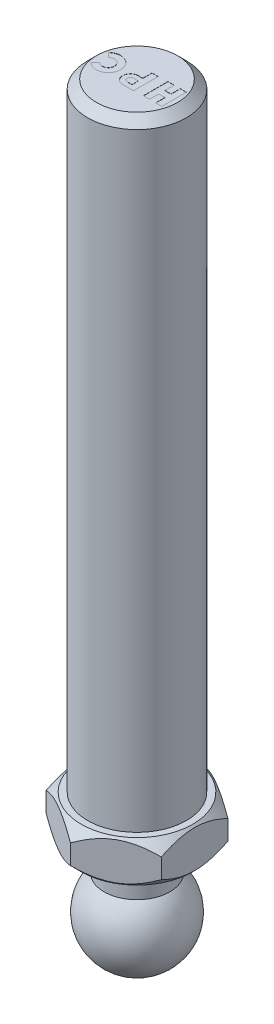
ISO-10303-21;
HEADER;
FILE_DESCRIPTION(('STEP AP214'),'2;1');
FILE_NAME('part.step','',(''),(''),'','','');
FILE_SCHEMA(('AUTOMOTIVE_DESIGN { 1 0 10303 214 1 1 1 1 }'));
ENDSEC;
DATA;
#1=APPLICATION_CONTEXT('core data for automotive mechanical design processes');
#2=APPLICATION_PROTOCOL_DEFINITION('international standard','automotive_design',2000,#1);
#3=PRODUCT_CONTEXT('',#1,'mechanical');
#4=PRODUCT('Part','Part','',(#3));
#5=PRODUCT_RELATED_PRODUCT_CATEGORY('part','',(#4));
#6=PRODUCT_DEFINITION_FORMATION('','',#4);
#7=PRODUCT_DEFINITION_CONTEXT('part definition',#1,'design');
#8=PRODUCT_DEFINITION('design','',#6,#7);
#9=PRODUCT_DEFINITION_SHAPE('','',#8);
#10=(LENGTH_UNIT() NAMED_UNIT(*) SI_UNIT(.MILLI.,.METRE.));
#11=(NAMED_UNIT(*) PLANE_ANGLE_UNIT() SI_UNIT($,.RADIAN.));
#12=(NAMED_UNIT(*) SI_UNIT($,.STERADIAN.) SOLID_ANGLE_UNIT());
#13=UNCERTAINTY_MEASURE_WITH_UNIT(LENGTH_MEASURE(1.E-05),#10,'distance_accuracy_value','');
#14=(GEOMETRIC_REPRESENTATION_CONTEXT(3) GLOBAL_UNCERTAINTY_ASSIGNED_CONTEXT((#13)) GLOBAL_UNIT_ASSIGNED_CONTEXT((#10,
#11,#12)) REPRESENTATION_CONTEXT('',''));
#15=CARTESIAN_POINT('',(0.,0.,0.));
#16=DIRECTION('',(0.,0.,1.));
#17=DIRECTION('',(1.,0.,0.));
#18=AXIS2_PLACEMENT_3D('',#15,#16,#17);
#19=CARTESIAN_POINT('',(0.,28.4210526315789,0.));
#20=DIRECTION('',(-1.,0.,0.));
#21=DIRECTION('',(0.,0.,1.));
#22=AXIS2_PLACEMENT_3D('',#19,#20,#21);
#23=SPHERICAL_SURFACE('',#22,5.71428571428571);
#24=CARTESIAN_POINT('',(5.7142857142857,28.4210526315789,0.));
#25=VERTEX_POINT('',#24);
#26=VERTEX_LOOP('',#25);
#27=FACE_BOUND('',#26,.T.);
#28=CARTESIAN_POINT('',(-5.71428571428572,28.4210526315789,0.));
#29=VERTEX_POINT('',#28);
#30=VERTEX_LOOP('',#29);
#31=FACE_BOUND('',#30,.T.);
#32=CARTESIAN_POINT('',(0.,32.5018688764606,0.));
#33=DIRECTION('',(0.,-1.,0.));
#34=DIRECTION('',(0.,0.,-1.));
#35=AXIS2_PLACEMENT_3D('',#32,#33,#34);
#36=CIRCLE('',#35,4.);
#37=CARTESIAN_POINT('',(0.,32.5018688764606,-4.));
#38=VERTEX_POINT('',#37);
#39=EDGE_CURVE('E20',#38,#38,#36,.F.);
#40=ORIENTED_EDGE('',*,*,#39,.F.);
#41=EDGE_LOOP('',(#40));
#42=FACE_BOUND('',#41,.T.);
#43=ADVANCED_FACE('F16',(#27,#31,#42),#23,.T.);
#44=CARTESIAN_POINT('',(-4.9265,116.,0.));
#45=DIRECTION('',(0.,-1.,0.));
#46=DIRECTION('',(0.,0.,-1.));
#47=AXIS2_PLACEMENT_3D('',#44,#45,#46);
#48=PLANE('',#47);
#49=DIRECTION('',(-1.,0.,0.));
#50=VECTOR('',#49,1.);
#51=CARTESIAN_POINT('',(0.267766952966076,116.,0.125));
#52=LINE('',#51,#50);
#53=CARTESIAN_POINT('',(-0.302404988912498,116.,0.124999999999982));
#54=VERTEX_POINT('',#53);
#55=CARTESIAN_POINT('',(0.267766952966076,116.,0.125));
#56=VERTEX_POINT('',#55);
#57=EDGE_CURVE('E628',#54,#56,#52,.F.);
#58=ORIENTED_EDGE('',*,*,#57,.F.);
#59=CARTESIAN_POINT('',(-0.302404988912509,116.,0.499999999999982));
#60=DIRECTION('',(0.,-1.,0.));
#61=DIRECTION('',(0.,0.,-1.));
#62=AXIS2_PLACEMENT_3D('',#59,#60,#61);
#63=CIRCLE('',#62,0.375);
#64=CARTESIAN_POINT('',(-0.302404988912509,116.,0.874999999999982));
#65=VERTEX_POINT('',#64);
#66=EDGE_CURVE('E130',#65,#54,#63,.T.);
#67=ORIENTED_EDGE('',*,*,#66,.F.);
#68=DIRECTION('',(1.,0.,0.));
#69=VECTOR('',#68,1.);
#70=CARTESIAN_POINT('',(-0.302404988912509,116.,0.874999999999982));
#71=LINE('',#70,#69);
#72=CARTESIAN_POINT('',(0.267766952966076,116.,0.874999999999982));
#73=VERTEX_POINT('',#72);
#74=EDGE_CURVE('E135',#73,#65,#71,.F.);
#75=ORIENTED_EDGE('',*,*,#74,.F.);
#76=DIRECTION('',(0.,0.,-1.));
#77=VECTOR('',#76,1.);
#78=CARTESIAN_POINT('',(0.267766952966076,116.,0.874999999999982));
#79=LINE('',#78,#77);
#80=EDGE_CURVE('E152',#56,#73,#79,.F.);
#81=ORIENTED_EDGE('',*,*,#80,.F.);
#82=EDGE_LOOP('',(#58,#67,#75,#81));
#83=FACE_BOUND('',#82,.T.);
#84=ADVANCED_FACE('F147',(#83),#48,.F.);
#85=CARTESIAN_POINT('',(0.,116.,0.));
#86=DIRECTION('',(0.,-1.,0.));
#87=DIRECTION('',(0.,0.,-1.));
#88=AXIS2_PLACEMENT_3D('',#85,#86,#87);
#89=CYLINDRICAL_SURFACE('',#88,4.);
#90=ORIENTED_EDGE('',*,*,#39,.T.);
#91=EDGE_LOOP('',(#90));
#92=FACE_BOUND('',#91,.T.);
#93=CARTESIAN_POINT('',(0.,36.,0.));
#94=DIRECTION('',(0.,-1.,0.));
#95=DIRECTION('',(0.,0.,-1.));
#96=AXIS2_PLACEMENT_3D('',#93,#94,#95);
#97=CIRCLE('',#96,4.);
#98=CARTESIAN_POINT('',(0.,36.,-4.));
#99=VERTEX_POINT('',#98);
#100=EDGE_CURVE('E624',#99,#99,#97,.T.);
#101=ORIENTED_EDGE('',*,*,#100,.T.);
#102=EDGE_LOOP('',(#101));
#103=FACE_BOUND('',#102,.T.);
#104=ADVANCED_FACE('F767',(#92,#103),#89,.T.);
#105=CARTESIAN_POINT('',(0.267766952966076,115.98,0.874999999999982));
#106=DIRECTION('',(1.,0.,0.));
#107=DIRECTION('',(0.,0.,-1.));
#108=AXIS2_PLACEMENT_3D('',#105,#106,#107);
#109=PLANE('',#108);
#110=DIRECTION('',(0.,0.,1.));
#111=VECTOR('',#110,1.);
#112=CARTESIAN_POINT('',(0.267766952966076,115.98,0.499999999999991));
#113=LINE('',#112,#111);
#114=CARTESIAN_POINT('',(0.267766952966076,115.98,0.124999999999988));
#115=VERTEX_POINT('',#114);
#116=CARTESIAN_POINT('',(0.267766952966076,115.98,0.874999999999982));
#117=VERTEX_POINT('',#116);
#118=EDGE_CURVE('E606',#115,#117,#113,.T.);
#119=ORIENTED_EDGE('',*,*,#118,.F.);
#120=DIRECTION('',(0.,1.,0.));
#121=VECTOR('',#120,1.);
#122=CARTESIAN_POINT('',(0.267766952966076,115.98,0.125));
#123=LINE('',#122,#121);
#124=EDGE_CURVE('E625',#56,#115,#123,.F.);
#125=ORIENTED_EDGE('',*,*,#124,.F.);
#126=ORIENTED_EDGE('',*,*,#80,.T.);
#127=DIRECTION('',(0.,1.,0.));
#128=VECTOR('',#127,1.);
#129=CARTESIAN_POINT('',(0.267766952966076,115.98,0.874999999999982));
#130=LINE('',#129,#128);
#131=EDGE_CURVE('E158',#117,#73,#130,.T.);
#132=ORIENTED_EDGE('',*,*,#131,.F.);
#133=EDGE_LOOP('',(#119,#125,#126,#132));
#134=FACE_BOUND('',#133,.T.);
#135=ADVANCED_FACE('F743',(#134),#109,.T.);
#136=CARTESIAN_POINT('',(-0.302404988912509,115.98,0.874999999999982));
#137=DIRECTION('',(0.,0.,1.));
#138=DIRECTION('',(1.,0.,0.));
#139=AXIS2_PLACEMENT_3D('',#136,#137,#138);
#140=PLANE('',#139);
#141=DIRECTION('',(1.,0.,0.));
#142=VECTOR('',#141,1.);
#143=CARTESIAN_POINT('',(-0.302405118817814,115.98,0.874999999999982));
#144=LINE('',#143,#142);
#145=CARTESIAN_POINT('',(-0.302404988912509,115.98,0.874999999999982));
#146=VERTEX_POINT('',#145);
#147=EDGE_CURVE('E603',#117,#146,#144,.F.);
#148=ORIENTED_EDGE('',*,*,#147,.F.);
#149=ORIENTED_EDGE('',*,*,#131,.T.);
#150=ORIENTED_EDGE('',*,*,#74,.T.);
#151=DIRECTION('',(0.,-1.,0.));
#152=VECTOR('',#151,1.);
#153=CARTESIAN_POINT('',(-0.302404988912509,115.98,0.874999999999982));
#154=LINE('',#153,#152);
#155=EDGE_CURVE('E635',#146,#65,#154,.F.);
#156=ORIENTED_EDGE('',*,*,#155,.F.);
#157=EDGE_LOOP('',(#148,#149,#150,#156));
#158=FACE_BOUND('',#157,.T.);
#159=ADVANCED_FACE('F745',(#158),#140,.T.);
#160=CARTESIAN_POINT('',(-0.302404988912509,115.98,0.499999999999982));
#161=DIRECTION('',(0.,-1.,0.));
#162=DIRECTION('',(0.,0.,-1.));
#163=AXIS2_PLACEMENT_3D('',#160,#161,#162);
#164=CYLINDRICAL_SURFACE('',#163,0.375);
#165=CARTESIAN_POINT('',(-0.302404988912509,115.98,0.499999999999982));
#166=DIRECTION('',(0.,-1.,0.));
#167=DIRECTION('',(0.,0.,-1.));
#168=AXIS2_PLACEMENT_3D('',#165,#166,#167);
#169=CIRCLE('',#168,0.375);
#170=CARTESIAN_POINT('',(-0.302404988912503,115.98,0.124999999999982));
#171=VERTEX_POINT('',#170);
#172=EDGE_CURVE('E600',#146,#171,#169,.T.);
#173=ORIENTED_EDGE('',*,*,#172,.F.);
#174=ORIENTED_EDGE('',*,*,#155,.T.);
#175=ORIENTED_EDGE('',*,*,#66,.T.);
#176=DIRECTION('',(0.,1.,0.));
#177=VECTOR('',#176,1.);
#178=CARTESIAN_POINT('',(-0.302404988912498,115.98,0.124999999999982));
#179=LINE('',#178,#177);
#180=EDGE_CURVE('E621',#171,#54,#179,.T.);
#181=ORIENTED_EDGE('',*,*,#180,.F.);
#182=EDGE_LOOP('',(#173,#174,#175,#181));
#183=FACE_BOUND('',#182,.T.);
#184=ADVANCED_FACE('F646',(#183),#164,.T.);
#185=CARTESIAN_POINT('',(0.267766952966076,115.98,0.125));
#186=DIRECTION('',(0.,0.,-1.));
#187=DIRECTION('',(-1.,0.,0.));
#188=AXIS2_PLACEMENT_3D('',#185,#186,#187);
#189=PLANE('',#188);
#190=DIRECTION('',(1.,0.,0.));
#191=VECTOR('',#190,1.);
#192=CARTESIAN_POINT('',(-0.302405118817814,115.98,0.124999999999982));
#193=LINE('',#192,#191);
#194=EDGE_CURVE('E590',#171,#115,#193,.T.);
#195=ORIENTED_EDGE('',*,*,#194,.F.);
#196=ORIENTED_EDGE('',*,*,#180,.T.);
#197=ORIENTED_EDGE('',*,*,#57,.T.);
#198=ORIENTED_EDGE('',*,*,#124,.T.);
#199=EDGE_LOOP('',(#195,#196,#197,#198));
#200=FACE_BOUND('',#199,.T.);
#201=ADVANCED_FACE('F643',(#200),#189,.T.);
#202=CARTESIAN_POINT('',(-4.,36.,0.));
#203=DIRECTION('',(0.,1.,0.));
#204=DIRECTION('',(0.,0.,1.));
#205=AXIS2_PLACEMENT_3D('',#202,#203,#204);
#206=PLANE('',#205);
#207=ORIENTED_EDGE('',*,*,#100,.F.);
#208=EDGE_LOOP('',(#207));
#209=FACE_BOUND('',#208,.T.);
#210=CARTESIAN_POINT('',(0.,35.9999999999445,0.));
#211=DIRECTION('',(0.,1.,0.));
#212=DIRECTION('',(0.,0.,1.));
#213=AXIS2_PLACEMENT_3D('',#210,#211,#212);
#214=CIRCLE('',#213,6.77586206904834);
#215=CARTESIAN_POINT('',(0.,35.9999999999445,6.77586206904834));
#216=VERTEX_POINT('',#215);
#217=EDGE_CURVE('E586',#216,#216,#214,.T.);
#218=ORIENTED_EDGE('',*,*,#217,.F.);
#219=EDGE_LOOP('',(#218));
#220=FACE_BOUND('',#219,.T.);
#221=ADVANCED_FACE('F749',(#209,#220),#206,.F.);
#222=CARTESIAN_POINT('',(-0.302405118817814,115.98,0.499999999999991));
#223=DIRECTION('',(0.,1.,0.));
#224=DIRECTION('',(0.,0.,1.));
#225=AXIS2_PLACEMENT_3D('',#222,#223,#224);
#226=PLANE('',#225);
#227=CARTESIAN_POINT('',(-0.302405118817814,115.98,0.499999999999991));
#228=DIRECTION('',(0.,-1.,0.));
#229=DIRECTION('',(0.,0.,-1.));
#230=AXIS2_PLACEMENT_3D('',#227,#228,#229);
#231=CIRCLE('',#230,0.937500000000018);
#232=CARTESIAN_POINT('',(-0.302405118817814,115.98,-0.437500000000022));
#233=VERTEX_POINT('',#232);
#234=CARTESIAN_POINT('',(-0.302405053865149,115.98,1.4375));
#235=VERTEX_POINT('',#234);
#236=EDGE_CURVE('E547',#233,#235,#231,.F.);
#237=ORIENTED_EDGE('',*,*,#236,.T.);
#238=DIRECTION('',(1.,0.,0.));
#239=VECTOR('',#238,1.);
#240=CARTESIAN_POINT('',(-0.302404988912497,115.98,1.4375));
#241=LINE('',#240,#239);
#242=CARTESIAN_POINT('',(1.01776695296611,115.98,1.43749999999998));
#243=VERTEX_POINT('',#242);
#244=EDGE_CURVE('E580',#235,#243,#241,.T.);
#245=ORIENTED_EDGE('',*,*,#244,.T.);
#246=DIRECTION('',(0.,0.,-1.));
#247=VECTOR('',#246,1.);
#248=CARTESIAN_POINT('',(1.01776695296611,115.98,1.43749999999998));
#249=LINE('',#248,#247);
#250=CARTESIAN_POINT('',(1.01776695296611,115.98,-1.5625));
#251=VERTEX_POINT('',#250);
#252=EDGE_CURVE('E570',#243,#251,#249,.T.);
#253=ORIENTED_EDGE('',*,*,#252,.T.);
#254=DIRECTION('',(-1.,0.,0.));
#255=VECTOR('',#254,1.);
#256=CARTESIAN_POINT('',(1.01776695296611,115.98,-1.5625));
#257=LINE('',#256,#255);
#258=CARTESIAN_POINT('',(0.267766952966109,115.98,-1.5625));
#259=VERTEX_POINT('',#258);
#260=EDGE_CURVE('E561',#251,#259,#257,.T.);
#261=ORIENTED_EDGE('',*,*,#260,.T.);
#262=DIRECTION('',(0.,0.,1.));
#263=VECTOR('',#262,1.);
#264=CARTESIAN_POINT('',(0.267766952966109,115.98,-1.5625));
#265=LINE('',#264,#263);
#266=CARTESIAN_POINT('',(0.267766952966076,115.98,-0.437500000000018));
#267=VERTEX_POINT('',#266);
#268=EDGE_CURVE('E553',#259,#267,#265,.T.);
#269=ORIENTED_EDGE('',*,*,#268,.T.);
#270=DIRECTION('',(-1.,0.,0.));
#271=VECTOR('',#270,1.);
#272=CARTESIAN_POINT('',(0.267766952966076,115.98,-0.437500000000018));
#273=LINE('',#272,#271);
#274=EDGE_CURVE('E552',#267,#233,#273,.T.);
#275=ORIENTED_EDGE('',*,*,#274,.T.);
#276=EDGE_LOOP('',(#237,#245,#253,#261,#269,#275));
#277=FACE_BOUND('',#276,.T.);
#278=ORIENTED_EDGE('',*,*,#172,.T.);
#279=ORIENTED_EDGE('',*,*,#194,.T.);
#280=ORIENTED_EDGE('',*,*,#118,.T.);
#281=ORIENTED_EDGE('',*,*,#147,.T.);
#282=EDGE_LOOP('',(#278,#279,#280,#281));
#283=FACE_BOUND('',#282,.T.);
#284=ADVANCED_FACE('F747',(#277,#283),#226,.T.);
#285=CARTESIAN_POINT('',(-3.47689858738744,115.98,0.));
#286=DIRECTION('',(0.,1.,0.));
#287=DIRECTION('',(0.,0.,1.));
#288=AXIS2_PLACEMENT_3D('',#285,#286,#287);
#289=PLANE('',#288);
#290=DIRECTION('',(0.70710678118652,0.,0.707106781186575));
#291=VECTOR('',#290,1.);
#292=CARTESIAN_POINT('',(-4.53755875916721,115.98,-1.06066017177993));
#293=LINE('',#292,#291);
#294=CARTESIAN_POINT('',(-4.53755875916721,115.98,-1.06066017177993));
#295=VERTEX_POINT('',#294);
#296=CARTESIAN_POINT('',(-4.00722867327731,115.98,-0.530330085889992));
#297=VERTEX_POINT('',#296);
#298=EDGE_CURVE('E542',#295,#297,#293,.T.);
#299=ORIENTED_EDGE('',*,*,#298,.T.);
#300=CARTESIAN_POINT('',(-3.47689858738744,115.98,0.));
#301=DIRECTION('',(0.,-1.,0.));
#302=DIRECTION('',(0.,0.,-1.));
#303=AXIS2_PLACEMENT_3D('',#300,#301,#302);
#304=CIRCLE('',#303,0.75);
#305=CARTESIAN_POINT('',(-4.0072286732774,115.98,0.530330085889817));
#306=VERTEX_POINT('',#305);
#307=EDGE_CURVE('E538',#306,#297,#304,.F.);
#308=ORIENTED_EDGE('',*,*,#307,.F.);
#309=DIRECTION('',(-0.707106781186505,0.,0.70710678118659));
#310=VECTOR('',#309,1.);
#311=CARTESIAN_POINT('',(-4.0072286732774,115.98,0.530330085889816));
#312=LINE('',#311,#310);
#313=CARTESIAN_POINT('',(-4.53755875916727,115.98,1.06066017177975));
#314=VERTEX_POINT('',#313);
#315=EDGE_CURVE('E587',#306,#314,#312,.T.);
#316=ORIENTED_EDGE('',*,*,#315,.T.);
#317=CARTESIAN_POINT('',(-3.47689858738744,115.98,0.));
#318=DIRECTION('',(0.,-1.,0.));
#319=DIRECTION('',(0.,0.,-1.));
#320=AXIS2_PLACEMENT_3D('',#317,#318,#319);
#321=CIRCLE('',#320,1.5);
#322=EDGE_CURVE('E543',#314,#295,#321,.F.);
#323=ORIENTED_EDGE('',*,*,#322,.T.);
#324=EDGE_LOOP('',(#299,#308,#316,#323));
#325=FACE_BOUND('',#324,.T.);
#326=ADVANCED_FACE('F660',(#325),#289,.T.);
#327=CARTESIAN_POINT('',(0.,115.98,0.));
#328=DIRECTION('',(0.,1.,0.));
#329=DIRECTION('',(0.,0.,1.));
#330=AXIS2_PLACEMENT_3D('',#327,#328,#329);
#331=PLANE('',#330);
#332=DIRECTION('',(0.,0.,1.));
#333=VECTOR('',#332,1.);
#334=CARTESIAN_POINT('',(3.63743249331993,115.98,0.25));
#335=LINE('',#334,#333);
#336=CARTESIAN_POINT('',(3.63743249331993,115.98,0.25));
#337=VERTEX_POINT('',#336);
#338=CARTESIAN_POINT('',(3.63743249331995,115.98,1.375));
#339=VERTEX_POINT('',#338);
#340=EDGE_CURVE('E479',#337,#339,#335,.T.);
#341=ORIENTED_EDGE('',*,*,#340,.T.);
#342=DIRECTION('',(1.,0.,0.));
#343=VECTOR('',#342,1.);
#344=CARTESIAN_POINT('',(3.63743249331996,115.98,1.375));
#345=LINE('',#344,#343);
#346=CARTESIAN_POINT('',(4.38743249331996,115.98,1.37499999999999));
#347=VERTEX_POINT('',#346);
#348=EDGE_CURVE('E473',#339,#347,#345,.T.);
#349=ORIENTED_EDGE('',*,*,#348,.T.);
#350=DIRECTION('',(0.,0.,-1.));
#351=VECTOR('',#350,1.);
#352=CARTESIAN_POINT('',(4.38743249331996,115.98,1.37499999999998));
#353=LINE('',#352,#351);
#354=CARTESIAN_POINT('',(4.38743249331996,115.98,-1.625));
#355=VERTEX_POINT('',#354);
#356=EDGE_CURVE('E467',#347,#355,#353,.T.);
#357=ORIENTED_EDGE('',*,*,#356,.T.);
#358=DIRECTION('',(1.,0.,0.));
#359=VECTOR('',#358,1.);
#360=CARTESIAN_POINT('',(0.,115.98,-1.625));
#361=LINE('',#360,#359);
#362=CARTESIAN_POINT('',(3.63743249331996,115.98,-1.625));
#363=VERTEX_POINT('',#362);
#364=EDGE_CURVE('E583',#355,#363,#361,.F.);
#365=ORIENTED_EDGE('',*,*,#364,.T.);
#366=DIRECTION('',(0.,0.,1.));
#367=VECTOR('',#366,1.);
#368=CARTESIAN_POINT('',(3.63743249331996,115.98,-1.625));
#369=LINE('',#368,#367);
#370=CARTESIAN_POINT('',(3.63743249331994,115.98,-0.5));
#371=VERTEX_POINT('',#370);
#372=EDGE_CURVE('E527',#363,#371,#369,.T.);
#373=ORIENTED_EDGE('',*,*,#372,.T.);
#374=DIRECTION('',(-1.,0.,0.));
#375=VECTOR('',#374,1.);
#376=CARTESIAN_POINT('',(3.63743249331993,115.98,-0.5));
#377=LINE('',#376,#375);
#378=CARTESIAN_POINT('',(2.88743249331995,115.98,-0.5));
#379=VERTEX_POINT('',#378);
#380=EDGE_CURVE('E521',#371,#379,#377,.T.);
#381=ORIENTED_EDGE('',*,*,#380,.T.);
#382=DIRECTION('',(0.,0.,-1.));
#383=VECTOR('',#382,1.);
#384=CARTESIAN_POINT('',(2.88743249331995,115.98,-0.5));
#385=LINE('',#384,#383);
#386=CARTESIAN_POINT('',(2.88743249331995,115.98,-1.62500000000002));
#387=VERTEX_POINT('',#386);
#388=EDGE_CURVE('E515',#379,#387,#385,.T.);
#389=ORIENTED_EDGE('',*,*,#388,.T.);
#390=DIRECTION('',(-1.,0.,0.));
#391=VECTOR('',#390,1.);
#392=CARTESIAN_POINT('',(2.88743249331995,115.98,-1.62500000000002));
#393=LINE('',#392,#391);
#394=CARTESIAN_POINT('',(2.13743249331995,115.98,-1.62500000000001));
#395=VERTEX_POINT('',#394);
#396=EDGE_CURVE('E509',#387,#395,#393,.T.);
#397=ORIENTED_EDGE('',*,*,#396,.T.);
#398=DIRECTION('',(0.,0.,1.));
#399=VECTOR('',#398,1.);
#400=CARTESIAN_POINT('',(2.13743249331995,115.98,-1.625));
#401=LINE('',#400,#399);
#402=CARTESIAN_POINT('',(2.13743249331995,115.98,1.37499999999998));
#403=VERTEX_POINT('',#402);
#404=EDGE_CURVE('E503',#395,#403,#401,.T.);
#405=ORIENTED_EDGE('',*,*,#404,.T.);
#406=DIRECTION('',(1.,0.,0.));
#407=VECTOR('',#406,1.);
#408=CARTESIAN_POINT('',(2.13743249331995,115.98,1.37499999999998));
#409=LINE('',#408,#407);
#410=CARTESIAN_POINT('',(2.88743249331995,115.98,1.37499999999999));
#411=VERTEX_POINT('',#410);
#412=EDGE_CURVE('E497',#403,#411,#409,.T.);
#413=ORIENTED_EDGE('',*,*,#412,.T.);
#414=DIRECTION('',(0.,0.,-1.));
#415=VECTOR('',#414,1.);
#416=CARTESIAN_POINT('',(2.88743249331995,115.98,1.375));
#417=LINE('',#416,#415);
#418=CARTESIAN_POINT('',(2.88743249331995,115.98,0.25));
#419=VERTEX_POINT('',#418);
#420=EDGE_CURVE('E491',#411,#419,#417,.T.);
#421=ORIENTED_EDGE('',*,*,#420,.T.);
#422=DIRECTION('',(1.,0.,0.));
#423=VECTOR('',#422,1.);
#424=CARTESIAN_POINT('',(2.88743249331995,115.98,0.25));
#425=LINE('',#424,#423);
#426=EDGE_CURVE('E485',#419,#337,#425,.T.);
#427=ORIENTED_EDGE('',*,*,#426,.T.);
#428=EDGE_LOOP('',(#341,#349,#357,#365,#373,#381,#389,#397,#405,#413,#421,#427));
#429=FACE_BOUND('',#428,.T.);
#430=ADVANCED_FACE('F226',(#429),#331,.T.);
#431=CARTESIAN_POINT('',(0.,37.3148839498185,0.));
#432=DIRECTION('',(0.,1.,0.));
#433=DIRECTION('',(0.,0.,1.));
#434=AXIS2_PLACEMENT_3D('',#431,#432,#433);
#435=CONICAL_SURFACE('',#434,8.0907460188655,0.785398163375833);
#436=ORIENTED_EDGE('',*,*,#217,.T.);
#437=EDGE_LOOP('',(#436));
#438=FACE_BOUND('',#437,.T.);
#439=CARTESIAN_POINT('',(6.99999999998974,37.3070416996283,4.04145188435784));
#440=CARTESIAN_POINT('',(6.99999999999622,37.2375660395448,3.90247970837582));
#441=CARTESIAN_POINT('',(6.99999999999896,37.1702226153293,3.76243936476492));
#442=CARTESIAN_POINT('',(7.00000000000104,37.0404488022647,3.48001282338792));
#443=CARTESIAN_POINT('',(7.00000000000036,36.9780210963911,3.33762539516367));
#444=CARTESIAN_POINT('',(6.99999999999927,36.7985521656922,2.90530569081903));
#445=CARTESIAN_POINT('',(6.99999999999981,36.6900905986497,2.61171385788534));
#446=CARTESIAN_POINT('',(7.00000000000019,36.5043582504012,2.01966264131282));
#447=CARTESIAN_POINT('',(7.00000000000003,36.4266196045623,1.72135454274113));
#448=CARTESIAN_POINT('',(6.99999999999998,36.3366955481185,1.26898870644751));
#449=CARTESIAN_POINT('',(7.,36.3111802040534,1.1175341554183));
#450=CARTESIAN_POINT('',(7.,36.2696214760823,0.813342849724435));
#451=CARTESIAN_POINT('',(7.,36.2535766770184,0.660606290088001));
#452=CARTESIAN_POINT('',(7.,36.2266745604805,0.288395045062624));
#453=CARTESIAN_POINT('',(7.,36.2210307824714,0.068519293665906));
#454=CARTESIAN_POINT('',(7.,36.2305088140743,-0.370835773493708));
#455=CARTESIAN_POINT('',(7.,36.2456379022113,-0.590314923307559));
#456=CARTESIAN_POINT('',(7.,36.2957698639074,-1.02720385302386));
#457=CARTESIAN_POINT('',(7.,36.3307949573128,-1.24461104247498));
#458=CARTESIAN_POINT('',(7.,36.4188147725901,-1.67568866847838));
#459=CARTESIAN_POINT('',(7.,36.4718081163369,-1.88935939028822));
#460=CARTESIAN_POINT('',(7.,36.580823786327,-2.26863721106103));
#461=CARTESIAN_POINT('',(7.,36.6339774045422,-2.43508465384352));
#462=CARTESIAN_POINT('',(7.,36.7488489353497,-2.76499207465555));
#463=CARTESIAN_POINT('',(7.,36.8105671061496,-2.92845196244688));
#464=CARTESIAN_POINT('',(7.,36.9411845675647,-3.25186938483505));
#465=CARTESIAN_POINT('',(7.,37.0100612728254,-3.41183611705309));
#466=CARTESIAN_POINT('',(7.,37.1540918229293,-3.72880792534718));
#467=CARTESIAN_POINT('',(7.,37.2292418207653,-3.88581474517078));
#468=CARTESIAN_POINT('',(7.,37.3070416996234,-4.04145188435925));
#469=B_SPLINE_CURVE_WITH_KNOTS('',3,(#439,#440,#441,#442,#443,#444,#445,#446,#447,#448,#449,
#450,#451,#452,#453,#454,#455,#456,#457,#458,#459,#460,#461,#462,#463,#464,#465,#466,#467,#468),
.UNSPECIFIED.,.F.,.F.,(4,2,2,2,2,2,2,2,2,2,2,2,2,2,4),(0.,0.466085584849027,0.932423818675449,
1.8701339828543,2.79295648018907,3.25346288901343,3.71390046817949,4.37271974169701,
5.03176991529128,5.69155756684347,6.35129462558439,6.87523436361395,7.39918990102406,
7.92153983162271,8.44357175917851),.UNSPECIFIED.);
#470=CARTESIAN_POINT('',(7.00000000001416,37.3070416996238,4.04145188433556));
#471=VERTEX_POINT('',#470);
#472=CARTESIAN_POINT('',(7.00000000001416,37.3070416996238,-4.04145188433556));
#473=VERTEX_POINT('',#472);
#474=EDGE_CURVE('E215',#471,#473,#469,.T.);
#475=ORIENTED_EDGE('',*,*,#474,.F.);
#476=CARTESIAN_POINT('',(-3.15087938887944E-11,37.3070416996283,8.0829037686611));
#477=CARTESIAN_POINT('',(0.120353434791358,37.2375660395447,8.0134176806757));
#478=CARTESIAN_POINT('',(0.241631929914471,37.1702226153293,7.94339750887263));
#479=CARTESIAN_POINT('',(0.48622048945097,37.0404488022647,7.80218423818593));
#480=CARTESIAN_POINT('',(0.609531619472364,36.9780210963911,7.73099052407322));
#481=CARTESIAN_POINT('',(0.983931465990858,36.7985521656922,7.51483067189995));
#482=CARTESIAN_POINT('',(1.23818945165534,36.6900905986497,7.36803475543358));
#483=CARTESIAN_POINT('',(1.75092084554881,36.5043582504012,7.07200914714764));
#484=CARTESIAN_POINT('',(2.00926323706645,36.4266196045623,6.92285509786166));
#485=CARTESIAN_POINT('',(2.40102354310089,36.3366955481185,6.69667217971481));
#486=CARTESIAN_POINT('',(2.53218703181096,36.3111802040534,6.62094490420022));
#487=CARTESIAN_POINT('',(2.79562443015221,36.2696214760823,6.46884925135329));
#488=CARTESIAN_POINT('',(2.927898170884,36.2535766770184,6.39248097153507));
#489=CARTESIAN_POINT('',(3.2502425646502,36.2266745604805,6.20637534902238));
#490=CARTESIAN_POINT('',(3.44066055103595,36.2210307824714,6.09643747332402));
#491=CARTESIAN_POINT('',(3.8211532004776,36.2305088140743,5.87675993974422));
#492=CARTESIAN_POINT('',(4.01122771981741,36.2456379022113,5.76702036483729));
#493=CARTESIAN_POINT('',(4.38958463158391,36.2957698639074,5.54857589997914));
#494=CARTESIAN_POINT('',(4.57786478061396,36.3307949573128,5.43987230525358));
#495=CARTESIAN_POINT('',(4.951188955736,36.4188147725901,5.22433349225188));
#496=CARTESIAN_POINT('',(5.13623322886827,36.4718081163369,5.11749813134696));
#497=CARTESIAN_POINT('',(5.46469745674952,36.580823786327,4.92785922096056));
#498=CARTESIAN_POINT('',(5.60884517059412,36.6339774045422,4.84463549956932));
#499=CARTESIAN_POINT('',(5.89455337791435,36.7488489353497,4.6796817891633));
#500=CARTESIAN_POINT('',(6.03611379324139,36.8105671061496,4.59795184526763));
#501=CARTESIAN_POINT('',(6.31620149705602,36.9411845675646,4.43624313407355));
#502=CARTESIAN_POINT('',(6.45473675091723,37.0100612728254,4.35625976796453));
#503=CARTESIAN_POINT('',(6.72924238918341,37.1540918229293,4.19777386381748));
#504=CARTESIAN_POINT('',(6.86521428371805,37.2292418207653,4.11927045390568));
#505=CARTESIAN_POINT('',(7.0000000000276,37.3070416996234,4.04145188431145));
#506=B_SPLINE_CURVE_WITH_KNOTS('',3,(#476,#477,#478,#479,#480,#481,#482,#483,#484,#485,#486,
#487,#488,#489,#490,#491,#492,#493,#494,#495,#496,#497,#498,#499,#500,#501,#502,#503,#504,#505),
.UNSPECIFIED.,.F.,.F.,(4,2,2,2,2,2,2,2,2,2,2,2,2,2,4),(0.,0.46608558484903,0.93242381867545,
1.8701339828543,2.79295648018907,3.25346288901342,3.71390046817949,4.372719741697,
5.03176991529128,5.69155756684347,6.35129462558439,6.87523436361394,7.39918990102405,
7.9215398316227,8.44357175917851),.UNSPECIFIED.);
#507=CARTESIAN_POINT('',(0.,37.3070416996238,8.08290376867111));
#508=VERTEX_POINT('',#507);
#509=EDGE_CURVE('E243',#508,#471,#506,.T.);
#510=ORIENTED_EDGE('',*,*,#509,.F.);
#511=CARTESIAN_POINT('',(-7.00000000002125,37.3070416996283,4.04145188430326));
#512=CARTESIAN_POINT('',(-6.87964656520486,37.2375660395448,4.11093797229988));
#513=CARTESIAN_POINT('',(-6.75836807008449,37.1702226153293,4.18095814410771));
#514=CARTESIAN_POINT('',(-6.51377951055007,37.0404488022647,4.32217141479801));
#515=CARTESIAN_POINT('',(-6.390468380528,36.9780210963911,4.39336512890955));
#516=CARTESIAN_POINT('',(-6.01606853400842,36.7985521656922,4.60952498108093));
#517=CARTESIAN_POINT('',(-5.76181054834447,36.6900905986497,4.75632089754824));
#518=CARTESIAN_POINT('',(-5.24907915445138,36.5043582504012,5.05234650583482));
#519=CARTESIAN_POINT('',(-4.99073676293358,36.4266196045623,5.20150055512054));
#520=CARTESIAN_POINT('',(-4.59897645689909,36.3366955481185,5.4276834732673));
#521=CARTESIAN_POINT('',(-4.46781296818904,36.3111802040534,5.50341074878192));
#522=CARTESIAN_POINT('',(-4.20437556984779,36.2696214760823,5.65550640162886));
#523=CARTESIAN_POINT('',(-4.072101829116,36.2535766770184,5.73187468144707));
#524=CARTESIAN_POINT('',(-3.74975743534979,36.2266745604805,5.91798030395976));
#525=CARTESIAN_POINT('',(-3.55933944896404,36.2210307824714,6.02791817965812));
#526=CARTESIAN_POINT('',(-3.1788467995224,36.2305088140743,6.24759571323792));
#527=CARTESIAN_POINT('',(-2.98877228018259,36.2456379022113,6.35733528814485));
#528=CARTESIAN_POINT('',(-2.61041536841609,36.2957698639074,6.575779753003));
#529=CARTESIAN_POINT('',(-2.42213521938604,36.3307949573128,6.68448334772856));
#530=CARTESIAN_POINT('',(-2.048811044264,36.4188147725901,6.90002216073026));
#531=CARTESIAN_POINT('',(-1.86376677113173,36.4718081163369,7.00685752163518));
#532=CARTESIAN_POINT('',(-1.53530254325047,36.580823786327,7.19649643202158));
#533=CARTESIAN_POINT('',(-1.39115482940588,36.6339774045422,7.27972015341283));
#534=CARTESIAN_POINT('',(-1.10544662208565,36.7488489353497,7.44467386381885));
#535=CARTESIAN_POINT('',(-0.963886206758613,36.8105671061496,7.52640380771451));
#536=CARTESIAN_POINT('',(-0.683798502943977,36.9411845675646,7.68811251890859));
#537=CARTESIAN_POINT('',(-0.545263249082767,37.0100612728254,7.76809588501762));
#538=CARTESIAN_POINT('',(-0.270757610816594,37.1540918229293,7.92658178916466));
#539=CARTESIAN_POINT('',(-0.134785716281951,37.2292418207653,8.00508519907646));
#540=CARTESIAN_POINT('',(2.75965551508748E-11,37.3070416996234,8.08290376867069));
#541=B_SPLINE_CURVE_WITH_KNOTS('',3,(#511,#512,#513,#514,#515,#516,#517,#518,#519,#520,#521,
#522,#523,#524,#525,#526,#527,#528,#529,#530,#531,#532,#533,#534,#535,#536,#537,#538,#539,#540),
.UNSPECIFIED.,.F.,.F.,(4,2,2,2,2,2,2,2,2,2,2,2,2,2,4),(0.,0.466085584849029,0.932423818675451,
1.8701339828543,2.79295648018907,3.25346288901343,3.71390046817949,4.37271974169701,
5.03176991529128,5.69155756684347,6.35129462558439,6.87523436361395,7.39918990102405,
7.92153983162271,8.4435717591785),.UNSPECIFIED.);
#542=CARTESIAN_POINT('',(-7.00000000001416,37.3070416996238,4.04145188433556));
#543=VERTEX_POINT('',#542);
#544=EDGE_CURVE('E248',#543,#508,#541,.T.);
#545=ORIENTED_EDGE('',*,*,#544,.F.);
#546=CARTESIAN_POINT('',(-6.99999999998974,37.3070416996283,-4.04145188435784));
#547=CARTESIAN_POINT('',(-6.99999999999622,37.2375660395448,-3.90247970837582));
#548=CARTESIAN_POINT('',(-6.99999999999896,37.1702226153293,-3.76243936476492));
#549=CARTESIAN_POINT('',(-7.00000000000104,37.0404488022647,-3.48001282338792));
#550=CARTESIAN_POINT('',(-7.00000000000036,36.9780210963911,-3.33762539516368));
#551=CARTESIAN_POINT('',(-6.99999999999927,36.7985521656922,-2.90530569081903));
#552=CARTESIAN_POINT('',(-6.99999999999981,36.6900905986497,-2.61171385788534));
#553=CARTESIAN_POINT('',(-7.00000000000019,36.5043582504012,-2.01966264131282));
#554=CARTESIAN_POINT('',(-7.00000000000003,36.4266196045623,-1.72135454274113));
#555=CARTESIAN_POINT('',(-6.99999999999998,36.3366955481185,-1.26898870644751));
#556=CARTESIAN_POINT('',(-7.,36.3111802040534,-1.1175341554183));
#557=CARTESIAN_POINT('',(-7.,36.2696214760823,-0.813342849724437));
#558=CARTESIAN_POINT('',(-7.,36.2535766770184,-0.660606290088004));
#559=CARTESIAN_POINT('',(-7.,36.2266745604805,-0.288395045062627));
#560=CARTESIAN_POINT('',(-7.,36.2210307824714,-0.0685192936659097));
#561=CARTESIAN_POINT('',(-7.,36.2305088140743,0.370835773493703));
#562=CARTESIAN_POINT('',(-7.,36.2456379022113,0.590314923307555));
#563=CARTESIAN_POINT('',(-7.,36.2957698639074,1.02720385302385));
#564=CARTESIAN_POINT('',(-7.,36.3307949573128,1.24461104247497));
#565=CARTESIAN_POINT('',(-7.,36.4188147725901,1.67568866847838));
#566=CARTESIAN_POINT('',(-7.,36.4718081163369,1.88935939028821));
#567=CARTESIAN_POINT('',(-7.,36.580823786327,2.26863721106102));
#568=CARTESIAN_POINT('',(-7.,36.6339774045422,2.43508465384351));
#569=CARTESIAN_POINT('',(-7.,36.7488489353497,2.76499207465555));
#570=CARTESIAN_POINT('',(-7.,36.8105671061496,2.92845196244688));
#571=CARTESIAN_POINT('',(-7.,36.9411845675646,3.25186938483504));
#572=CARTESIAN_POINT('',(-7.,37.0100612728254,3.41183611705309));
#573=CARTESIAN_POINT('',(-7.,37.1540918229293,3.72880792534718));
#574=CARTESIAN_POINT('',(-7.,37.2292418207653,3.88581474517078));
#575=CARTESIAN_POINT('',(-7.,37.3070416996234,4.04145188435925));
#576=B_SPLINE_CURVE_WITH_KNOTS('',3,(#546,#547,#548,#549,#550,#551,#552,#553,#554,#555,#556,
#557,#558,#559,#560,#561,#562,#563,#564,#565,#566,#567,#568,#569,#570,#571,#572,#573,#574,#575),
.UNSPECIFIED.,.F.,.F.,(4,2,2,2,2,2,2,2,2,2,2,2,2,2,4),(0.,0.466085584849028,0.93242381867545,
1.8701339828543,2.79295648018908,3.25346288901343,3.71390046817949,4.37271974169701,
5.03176991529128,5.69155756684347,6.35129462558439,6.87523436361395,7.39918990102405,
7.9215398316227,8.4435717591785),.UNSPECIFIED.);
#577=CARTESIAN_POINT('',(-7.00000000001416,37.3070416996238,-4.04145188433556));
#578=VERTEX_POINT('',#577);
#579=EDGE_CURVE('E256',#578,#543,#576,.T.);
#580=ORIENTED_EDGE('',*,*,#579,.F.);
#581=CARTESIAN_POINT('',(3.15085531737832E-11,37.3070416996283,-8.0829037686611));
#582=CARTESIAN_POINT('',(-0.120353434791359,37.2375660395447,-8.0134176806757));
#583=CARTESIAN_POINT('',(-0.241631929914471,37.1702226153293,-7.94339750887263));
#584=CARTESIAN_POINT('',(-0.48622048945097,37.0404488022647,-7.80218423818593));
#585=CARTESIAN_POINT('',(-0.609531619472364,36.9780210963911,-7.73099052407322));
#586=CARTESIAN_POINT('',(-0.983931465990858,36.7985521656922,-7.51483067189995));
#587=CARTESIAN_POINT('',(-1.23818945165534,36.6900905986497,-7.36803475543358));
#588=CARTESIAN_POINT('',(-1.75092084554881,36.5043582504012,-7.07200914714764));
#589=CARTESIAN_POINT('',(-2.00926323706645,36.4266196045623,-6.92285509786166));
#590=CARTESIAN_POINT('',(-2.40102354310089,36.3366955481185,-6.69667217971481));
#591=CARTESIAN_POINT('',(-2.53218703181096,36.3111802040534,-6.62094490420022));
#592=CARTESIAN_POINT('',(-2.79562443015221,36.2696214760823,-6.46884925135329));
#593=CARTESIAN_POINT('',(-2.927898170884,36.2535766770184,-6.39248097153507));
#594=CARTESIAN_POINT('',(-3.2502425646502,36.2266745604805,-6.20637534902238));
#595=CARTESIAN_POINT('',(-3.44066055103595,36.2210307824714,-6.09643747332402));
#596=CARTESIAN_POINT('',(-3.8211532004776,36.2305088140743,-5.87675993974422));
#597=CARTESIAN_POINT('',(-4.01122771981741,36.2456379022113,-5.76702036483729));
#598=CARTESIAN_POINT('',(-4.38958463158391,36.2957698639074,-5.54857589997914));
#599=CARTESIAN_POINT('',(-4.57786478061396,36.3307949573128,-5.43987230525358));
#600=CARTESIAN_POINT('',(-4.951188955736,36.4188147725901,-5.22433349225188));
#601=CARTESIAN_POINT('',(-5.13623322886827,36.4718081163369,-5.11749813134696));
#602=CARTESIAN_POINT('',(-5.46469745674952,36.580823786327,-4.92785922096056));
#603=CARTESIAN_POINT('',(-5.60884517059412,36.6339774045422,-4.84463549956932));
#604=CARTESIAN_POINT('',(-5.89455337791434,36.7488489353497,-4.6796817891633));
#605=CARTESIAN_POINT('',(-6.03611379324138,36.8105671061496,-4.59795184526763));
#606=CARTESIAN_POINT('',(-6.31620149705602,36.9411845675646,-4.43624313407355));
#607=CARTESIAN_POINT('',(-6.45473675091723,37.0100612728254,-4.35625976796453));
#608=CARTESIAN_POINT('',(-6.7292423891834,37.1540918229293,-4.19777386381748));
#609=CARTESIAN_POINT('',(-6.86521428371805,37.2292418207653,-4.11927045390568));
#610=CARTESIAN_POINT('',(-7.0000000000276,37.3070416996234,-4.04145188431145));
#611=B_SPLINE_CURVE_WITH_KNOTS('',3,(#581,#582,#583,#584,#585,#586,#587,#588,#589,#590,#591,
#592,#593,#594,#595,#596,#597,#598,#599,#600,#601,#602,#603,#604,#605,#606,#607,#608,#609,#610),
.UNSPECIFIED.,.F.,.F.,(4,2,2,2,2,2,2,2,2,2,2,2,2,2,4),(0.,0.46608558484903,0.93242381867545,
1.8701339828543,2.79295648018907,3.25346288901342,3.71390046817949,4.372719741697,
5.03176991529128,5.69155756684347,6.35129462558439,6.87523436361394,7.39918990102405,
7.9215398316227,8.4435717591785),.UNSPECIFIED.);
#612=CARTESIAN_POINT('',(1.41630118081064E-11,37.3070416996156,-8.08290376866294));
#613=VERTEX_POINT('',#612);
#614=EDGE_CURVE('E233',#613,#578,#611,.T.);
#615=ORIENTED_EDGE('',*,*,#614,.F.);
#616=CARTESIAN_POINT('',(7.00000000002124,37.3070416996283,-4.04145188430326));
#617=CARTESIAN_POINT('',(6.87964656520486,37.2375660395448,-4.11093797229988));
#618=CARTESIAN_POINT('',(6.75836807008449,37.1702226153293,-4.18095814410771));
#619=CARTESIAN_POINT('',(6.51377951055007,37.0404488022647,-4.32217141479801));
#620=CARTESIAN_POINT('',(6.390468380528,36.9780210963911,-4.39336512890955));
#621=CARTESIAN_POINT('',(6.01606853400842,36.7985521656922,-4.60952498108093));
#622=CARTESIAN_POINT('',(5.76181054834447,36.6900905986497,-4.75632089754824));
#623=CARTESIAN_POINT('',(5.24907915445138,36.5043582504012,-5.05234650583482));
#624=CARTESIAN_POINT('',(4.99073676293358,36.4266196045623,-5.20150055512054));
#625=CARTESIAN_POINT('',(4.59897645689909,36.3366955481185,-5.4276834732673));
#626=CARTESIAN_POINT('',(4.46781296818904,36.3111802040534,-5.50341074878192));
#627=CARTESIAN_POINT('',(4.20437556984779,36.2696214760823,-5.65550640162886));
#628=CARTESIAN_POINT('',(4.07210182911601,36.2535766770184,-5.73187468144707));
#629=CARTESIAN_POINT('',(3.74975743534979,36.2266745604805,-5.91798030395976));
#630=CARTESIAN_POINT('',(3.55933944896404,36.2210307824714,-6.02791817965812));
#631=CARTESIAN_POINT('',(3.1788467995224,36.2305088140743,-6.24759571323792));
#632=CARTESIAN_POINT('',(2.98877228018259,36.2456379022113,-6.35733528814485));
#633=CARTESIAN_POINT('',(2.61041536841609,36.2957698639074,-6.575779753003));
#634=CARTESIAN_POINT('',(2.42213521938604,36.3307949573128,-6.68448334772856));
#635=CARTESIAN_POINT('',(2.048811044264,36.4188147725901,-6.90002216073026));
#636=CARTESIAN_POINT('',(1.86376677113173,36.4718081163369,-7.00685752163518));
#637=CARTESIAN_POINT('',(1.53530254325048,36.580823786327,-7.19649643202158));
#638=CARTESIAN_POINT('',(1.39115482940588,36.6339774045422,-7.27972015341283));
#639=CARTESIAN_POINT('',(1.10544662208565,36.7488489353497,-7.44467386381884));
#640=CARTESIAN_POINT('',(0.963886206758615,36.8105671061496,-7.52640380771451));
#641=CARTESIAN_POINT('',(0.683798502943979,36.9411845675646,-7.68811251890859));
#642=CARTESIAN_POINT('',(0.545263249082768,37.0100612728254,-7.76809588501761));
#643=CARTESIAN_POINT('',(0.270757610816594,37.1540918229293,-7.92658178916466));
#644=CARTESIAN_POINT('',(0.13478571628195,37.2292418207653,-8.00508519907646));
#645=CARTESIAN_POINT('',(-2.75986683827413E-11,37.3070416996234,-8.08290376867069));
#646=B_SPLINE_CURVE_WITH_KNOTS('',3,(#616,#617,#618,#619,#620,#621,#622,#623,#624,#625,#626,
#627,#628,#629,#630,#631,#632,#633,#634,#635,#636,#637,#638,#639,#640,#641,#642,#643,#644,#645),
.UNSPECIFIED.,.F.,.F.,(4,2,2,2,2,2,2,2,2,2,2,2,2,2,4),(0.,0.466085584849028,0.932423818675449,
1.8701339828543,2.79295648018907,3.25346288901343,3.71390046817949,4.37271974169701,
5.03176991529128,5.69155756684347,6.35129462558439,6.87523436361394,7.39918990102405,
7.9215398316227,8.4435717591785),.UNSPECIFIED.);
#647=EDGE_CURVE('E203',#473,#613,#646,.T.);
#648=ORIENTED_EDGE('',*,*,#647,.F.);
#649=EDGE_LOOP('',(#475,#510,#545,#580,#615,#648));
#650=FACE_BOUND('',#649,.T.);
#651=ADVANCED_FACE('F220',(#438,#650),#435,.T.);
#652=CARTESIAN_POINT('',(-0.302404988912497,115.98,1.4375));
#653=DIRECTION('',(0.,0.,1.));
#654=DIRECTION('',(1.,0.,0.));
#655=AXIS2_PLACEMENT_3D('',#652,#653,#654);
#656=PLANE('',#655);
#657=DIRECTION('',(0.,1.,0.));
#658=VECTOR('',#657,1.);
#659=CARTESIAN_POINT('',(1.01776695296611,115.98,1.43749999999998));
#660=LINE('',#659,#658);
#661=CARTESIAN_POINT('',(1.01776695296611,116.,1.43749999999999));
#662=VERTEX_POINT('',#661);
#663=EDGE_CURVE('E577',#662,#243,#660,.F.);
#664=ORIENTED_EDGE('',*,*,#663,.T.);
#665=ORIENTED_EDGE('',*,*,#244,.F.);
#666=DIRECTION('',(0.,-1.,0.));
#667=VECTOR('',#666,1.);
#668=CARTESIAN_POINT('',(-0.302404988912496,115.98,1.4375));
#669=LINE('',#668,#667);
#670=CARTESIAN_POINT('',(-0.302405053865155,116.,1.4375));
#671=VERTEX_POINT('',#670);
#672=EDGE_CURVE('E544',#235,#671,#669,.F.);
#673=ORIENTED_EDGE('',*,*,#672,.T.);
#674=DIRECTION('',(1.,0.,0.));
#675=VECTOR('',#674,1.);
#676=CARTESIAN_POINT('',(-4.9265,116.,1.4375));
#677=LINE('',#676,#675);
#678=EDGE_CURVE('E443',#671,#662,#677,.T.);
#679=ORIENTED_EDGE('',*,*,#678,.T.);
#680=EDGE_LOOP('',(#664,#665,#673,#679));
#681=FACE_BOUND('',#680,.T.);
#682=ADVANCED_FACE('F225',(#681),#656,.F.);
#683=CARTESIAN_POINT('',(1.01776695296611,115.98,1.43749999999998));
#684=DIRECTION('',(1.,0.,0.));
#685=DIRECTION('',(0.,0.,-1.));
#686=AXIS2_PLACEMENT_3D('',#683,#684,#685);
#687=PLANE('',#686);
#688=DIRECTION('',(0.,1.,0.));
#689=VECTOR('',#688,1.);
#690=CARTESIAN_POINT('',(1.01776695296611,115.98,-1.5625));
#691=LINE('',#690,#689);
#692=CARTESIAN_POINT('',(1.01776695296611,116.,-1.5625));
#693=VERTEX_POINT('',#692);
#694=EDGE_CURVE('E568',#693,#251,#691,.F.);
#695=ORIENTED_EDGE('',*,*,#694,.T.);
#696=ORIENTED_EDGE('',*,*,#252,.F.);
#697=ORIENTED_EDGE('',*,*,#663,.F.);
#698=DIRECTION('',(0.,0.,-1.));
#699=VECTOR('',#698,1.);
#700=CARTESIAN_POINT('',(1.01776695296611,116.,0.));
#701=LINE('',#700,#699);
#702=EDGE_CURVE('E446',#662,#693,#701,.T.);
#703=ORIENTED_EDGE('',*,*,#702,.T.);
#704=EDGE_LOOP('',(#695,#696,#697,#703));
#705=FACE_BOUND('',#704,.T.);
#706=ADVANCED_FACE('F379',(#705),#687,.F.);
#707=CARTESIAN_POINT('',(1.01776695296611,115.98,-1.5625));
#708=DIRECTION('',(0.,0.,-1.));
#709=DIRECTION('',(-1.,0.,0.));
#710=AXIS2_PLACEMENT_3D('',#707,#708,#709);
#711=PLANE('',#710);
#712=DIRECTION('',(0.,1.,0.));
#713=VECTOR('',#712,1.);
#714=CARTESIAN_POINT('',(0.267766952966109,115.98,-1.5625));
#715=LINE('',#714,#713);
#716=CARTESIAN_POINT('',(0.267766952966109,116.,-1.5625));
#717=VERTEX_POINT('',#716);
#718=EDGE_CURVE('E558',#717,#259,#715,.F.);
#719=ORIENTED_EDGE('',*,*,#718,.T.);
#720=ORIENTED_EDGE('',*,*,#260,.F.);
#721=ORIENTED_EDGE('',*,*,#694,.F.);
#722=DIRECTION('',(1.,0.,0.));
#723=VECTOR('',#722,1.);
#724=CARTESIAN_POINT('',(-4.9265,116.,-1.5625));
#725=LINE('',#724,#723);
#726=EDGE_CURVE('E435',#693,#717,#725,.F.);
#727=ORIENTED_EDGE('',*,*,#726,.T.);
#728=EDGE_LOOP('',(#719,#720,#721,#727));
#729=FACE_BOUND('',#728,.T.);
#730=ADVANCED_FACE('F376',(#729),#711,.F.);
#731=CARTESIAN_POINT('',(0.267766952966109,115.98,-1.5625));
#732=DIRECTION('',(-1.,0.,0.));
#733=DIRECTION('',(0.,0.,1.));
#734=AXIS2_PLACEMENT_3D('',#731,#732,#733);
#735=PLANE('',#734);
#736=DIRECTION('',(0.,1.,0.));
#737=VECTOR('',#736,1.);
#738=CARTESIAN_POINT('',(0.267766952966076,115.98,-0.437500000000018));
#739=LINE('',#738,#737);
#740=CARTESIAN_POINT('',(0.267766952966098,116.,-0.437500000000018));
#741=VERTEX_POINT('',#740);
#742=EDGE_CURVE('E549',#741,#267,#739,.F.);
#743=ORIENTED_EDGE('',*,*,#742,.T.);
#744=ORIENTED_EDGE('',*,*,#268,.F.);
#745=ORIENTED_EDGE('',*,*,#718,.F.);
#746=DIRECTION('',(0.,0.,-1.));
#747=VECTOR('',#746,1.);
#748=CARTESIAN_POINT('',(0.267766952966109,116.,0.));
#749=LINE('',#748,#747);
#750=EDGE_CURVE('E426',#717,#741,#749,.F.);
#751=ORIENTED_EDGE('',*,*,#750,.T.);
#752=EDGE_LOOP('',(#743,#744,#745,#751));
#753=FACE_BOUND('',#752,.T.);
#754=ADVANCED_FACE('F372',(#753),#735,.F.);
#755=CARTESIAN_POINT('',(0.267766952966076,115.98,-0.437500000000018));
#756=DIRECTION('',(0.,0.,-1.));
#757=DIRECTION('',(-1.,0.,0.));
#758=AXIS2_PLACEMENT_3D('',#755,#756,#757);
#759=PLANE('',#758);
#760=DIRECTION('',(0.,-1.,0.));
#761=VECTOR('',#760,1.);
#762=CARTESIAN_POINT('',(-0.302405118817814,115.98,-0.437500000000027));
#763=LINE('',#762,#761);
#764=CARTESIAN_POINT('',(-0.302405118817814,116.,-0.437500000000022));
#765=VERTEX_POINT('',#764);
#766=EDGE_CURVE('E546',#765,#233,#763,.T.);
#767=ORIENTED_EDGE('',*,*,#766,.T.);
#768=ORIENTED_EDGE('',*,*,#274,.F.);
#769=ORIENTED_EDGE('',*,*,#742,.F.);
#770=DIRECTION('',(1.,0.,0.));
#771=VECTOR('',#770,1.);
#772=CARTESIAN_POINT('',(-4.9265,116.,-0.437500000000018));
#773=LINE('',#772,#771);
#774=EDGE_CURVE('E422',#741,#765,#773,.F.);
#775=ORIENTED_EDGE('',*,*,#774,.T.);
#776=EDGE_LOOP('',(#767,#768,#769,#775));
#777=FACE_BOUND('',#776,.T.);
#778=ADVANCED_FACE('F368',(#777),#759,.F.);
#779=CARTESIAN_POINT('',(-0.302405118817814,115.98,0.499999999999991));
#780=DIRECTION('',(0.,-1.,0.));
#781=DIRECTION('',(0.,0.,-1.));
#782=AXIS2_PLACEMENT_3D('',#779,#780,#781);
#783=CYLINDRICAL_SURFACE('',#782,0.937500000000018);
#784=CARTESIAN_POINT('',(-0.302405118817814,116.,0.499999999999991));
#785=DIRECTION('',(0.,-1.,0.));
#786=DIRECTION('',(0.,0.,-1.));
#787=AXIS2_PLACEMENT_3D('',#784,#785,#786);
#788=CIRCLE('',#787,0.937500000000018);
#789=EDGE_CURVE('E213',#765,#671,#788,.F.);
#790=ORIENTED_EDGE('',*,*,#789,.T.);
#791=ORIENTED_EDGE('',*,*,#672,.F.);
#792=ORIENTED_EDGE('',*,*,#236,.F.);
#793=ORIENTED_EDGE('',*,*,#766,.F.);
#794=EDGE_LOOP('',(#790,#791,#792,#793));
#795=FACE_BOUND('',#794,.T.);
#796=ADVANCED_FACE('F364',(#795),#783,.F.);
#797=CARTESIAN_POINT('',(-3.47689858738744,115.98,0.));
#798=DIRECTION('',(0.,-1.,0.));
#799=DIRECTION('',(0.,0.,-1.));
#800=AXIS2_PLACEMENT_3D('',#797,#798,#799);
#801=CYLINDRICAL_SURFACE('',#800,1.5);
#802=CARTESIAN_POINT('',(-3.47689858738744,116.,0.));
#803=DIRECTION('',(0.,-1.,0.));
#804=DIRECTION('',(0.,0.,-1.));
#805=AXIS2_PLACEMENT_3D('',#802,#803,#804);
#806=CIRCLE('',#805,1.5);
#807=CARTESIAN_POINT('',(-4.53755875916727,116.,1.06066017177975));
#808=VERTEX_POINT('',#807);
#809=CARTESIAN_POINT('',(-4.53755875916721,116.,-1.06066017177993));
#810=VERTEX_POINT('',#809);
#811=EDGE_CURVE('E434',#808,#810,#806,.F.);
#812=ORIENTED_EDGE('',*,*,#811,.T.);
#813=DIRECTION('',(0.,1.,0.));
#814=VECTOR('',#813,1.);
#815=CARTESIAN_POINT('',(-4.53755875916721,115.98,-1.06066017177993));
#816=LINE('',#815,#814);
#817=EDGE_CURVE('E539',#810,#295,#816,.F.);
#818=ORIENTED_EDGE('',*,*,#817,.T.);
#819=ORIENTED_EDGE('',*,*,#322,.F.);
#820=DIRECTION('',(0.,1.,0.));
#821=VECTOR('',#820,1.);
#822=CARTESIAN_POINT('',(-4.53755875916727,115.98,1.06066017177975));
#823=LINE('',#822,#821);
#824=EDGE_CURVE('E530',#314,#808,#823,.T.);
#825=ORIENTED_EDGE('',*,*,#824,.T.);
#826=EDGE_LOOP('',(#812,#818,#819,#825));
#827=FACE_BOUND('',#826,.T.);
#828=ADVANCED_FACE('F360',(#827),#801,.F.);
#829=CARTESIAN_POINT('',(-4.53755875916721,115.98,-1.06066017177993));
#830=DIRECTION('',(-0.707106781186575,0.,0.70710678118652));
#831=DIRECTION('',(0.70710678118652,0.,0.707106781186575));
#832=AXIS2_PLACEMENT_3D('',#829,#830,#831);
#833=PLANE('',#832);
#834=DIRECTION('',(0.,-1.,0.));
#835=VECTOR('',#834,1.);
#836=CARTESIAN_POINT('',(-4.00722867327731,115.98,-0.530330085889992));
#837=LINE('',#836,#835);
#838=CARTESIAN_POINT('',(-4.00722867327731,116.,-0.530330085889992));
#839=VERTEX_POINT('',#838);
#840=EDGE_CURVE('E534',#297,#839,#837,.F.);
#841=ORIENTED_EDGE('',*,*,#840,.F.);
#842=ORIENTED_EDGE('',*,*,#298,.F.);
#843=ORIENTED_EDGE('',*,*,#817,.F.);
#844=DIRECTION('',(0.707106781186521,0.,0.707106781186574));
#845=VECTOR('',#844,1.);
#846=CARTESIAN_POINT('',(-4.53755875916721,116.,-1.06066017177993));
#847=LINE('',#846,#845);
#848=EDGE_CURVE('E439',#810,#839,#847,.T.);
#849=ORIENTED_EDGE('',*,*,#848,.T.);
#850=EDGE_LOOP('',(#841,#842,#843,#849));
#851=FACE_BOUND('',#850,.T.);
#852=ADVANCED_FACE('F356',(#851),#833,.F.);
#853=CARTESIAN_POINT('',(-3.47689858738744,115.98,0.));
#854=DIRECTION('',(0.,-1.,0.));
#855=DIRECTION('',(0.,0.,-1.));
#856=AXIS2_PLACEMENT_3D('',#853,#854,#855);
#857=CYLINDRICAL_SURFACE('',#856,0.75);
#858=ORIENTED_EDGE('',*,*,#307,.T.);
#859=ORIENTED_EDGE('',*,*,#840,.T.);
#860=CARTESIAN_POINT('',(-3.47689858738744,116.,0.));
#861=DIRECTION('',(0.,-1.,0.));
#862=DIRECTION('',(0.,0.,-1.));
#863=AXIS2_PLACEMENT_3D('',#860,#861,#862);
#864=CIRCLE('',#863,0.75);
#865=CARTESIAN_POINT('',(-4.0072286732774,116.,0.530330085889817));
#866=VERTEX_POINT('',#865);
#867=EDGE_CURVE('E294',#839,#866,#864,.T.);
#868=ORIENTED_EDGE('',*,*,#867,.T.);
#869=DIRECTION('',(0.,1.,0.));
#870=VECTOR('',#869,1.);
#871=CARTESIAN_POINT('',(-4.0072286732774,115.98,0.530330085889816));
#872=LINE('',#871,#870);
#873=EDGE_CURVE('E531',#866,#306,#872,.F.);
#874=ORIENTED_EDGE('',*,*,#873,.T.);
#875=EDGE_LOOP('',(#858,#859,#868,#874));
#876=FACE_BOUND('',#875,.T.);
#877=ADVANCED_FACE('F352',(#876),#857,.T.);
#878=CARTESIAN_POINT('',(-4.0072286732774,115.98,0.530330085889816));
#879=DIRECTION('',(-0.707106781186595,0.,-0.7071067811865));
#880=DIRECTION('',(-0.7071067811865,0.,0.707106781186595));
#881=AXIS2_PLACEMENT_3D('',#878,#879,#880);
#882=PLANE('',#881);
#883=ORIENTED_EDGE('',*,*,#824,.F.);
#884=ORIENTED_EDGE('',*,*,#315,.F.);
#885=ORIENTED_EDGE('',*,*,#873,.F.);
#886=DIRECTION('',(-0.707106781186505,0.,0.70710678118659));
#887=VECTOR('',#886,1.);
#888=CARTESIAN_POINT('',(-4.0072286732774,116.,0.530330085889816));
#889=LINE('',#888,#887);
#890=EDGE_CURVE('E665',#866,#808,#889,.T.);
#891=ORIENTED_EDGE('',*,*,#890,.T.);
#892=EDGE_LOOP('',(#883,#884,#885,#891));
#893=FACE_BOUND('',#892,.T.);
#894=ADVANCED_FACE('F348',(#893),#882,.F.);
#895=CARTESIAN_POINT('',(3.63743249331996,115.98,-1.625));
#896=DIRECTION('',(-1.,0.,0.));
#897=DIRECTION('',(0.,0.,1.));
#898=AXIS2_PLACEMENT_3D('',#895,#896,#897);
#899=PLANE('',#898);
#900=DIRECTION('',(0.,1.,0.));
#901=VECTOR('',#900,1.);
#902=CARTESIAN_POINT('',(3.63743249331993,115.98,-0.5));
#903=LINE('',#902,#901);
#904=CARTESIAN_POINT('',(3.63743249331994,116.,-0.5));
#905=VERTEX_POINT('',#904);
#906=EDGE_CURVE('E524',#905,#371,#903,.F.);
#907=ORIENTED_EDGE('',*,*,#906,.T.);
#908=ORIENTED_EDGE('',*,*,#372,.F.);
#909=DIRECTION('',(0.,1.,0.));
#910=VECTOR('',#909,1.);
#911=CARTESIAN_POINT('',(3.63743249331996,115.98,-1.625));
#912=LINE('',#911,#910);
#913=CARTESIAN_POINT('',(3.63743249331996,116.,-1.625));
#914=VERTEX_POINT('',#913);
#915=EDGE_CURVE('E461',#363,#914,#912,.T.);
#916=ORIENTED_EDGE('',*,*,#915,.T.);
#917=DIRECTION('',(0.,0.,-1.));
#918=VECTOR('',#917,1.);
#919=CARTESIAN_POINT('',(3.63743249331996,116.,0.));
#920=LINE('',#919,#918);
#921=EDGE_CURVE('E668',#914,#905,#920,.F.);
#922=ORIENTED_EDGE('',*,*,#921,.T.);
#923=EDGE_LOOP('',(#907,#908,#916,#922));
#924=FACE_BOUND('',#923,.T.);
#925=ADVANCED_FACE('F344',(#924),#899,.F.);
#926=CARTESIAN_POINT('',(3.63743249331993,115.98,-0.5));
#927=DIRECTION('',(0.,0.,-1.));
#928=DIRECTION('',(-1.,0.,0.));
#929=AXIS2_PLACEMENT_3D('',#926,#927,#928);
#930=PLANE('',#929);
#931=DIRECTION('',(0.,1.,0.));
#932=VECTOR('',#931,1.);
#933=CARTESIAN_POINT('',(2.88743249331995,115.98,-0.5));
#934=LINE('',#933,#932);
#935=CARTESIAN_POINT('',(2.88743249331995,116.,-0.5));
#936=VERTEX_POINT('',#935);
#937=EDGE_CURVE('E518',#936,#379,#934,.F.);
#938=ORIENTED_EDGE('',*,*,#937,.T.);
#939=ORIENTED_EDGE('',*,*,#380,.F.);
#940=ORIENTED_EDGE('',*,*,#906,.F.);
#941=DIRECTION('',(1.,0.,0.));
#942=VECTOR('',#941,1.);
#943=CARTESIAN_POINT('',(-4.9265,116.,-0.5));
#944=LINE('',#943,#942);
#945=EDGE_CURVE('E670',#905,#936,#944,.F.);
#946=ORIENTED_EDGE('',*,*,#945,.T.);
#947=EDGE_LOOP('',(#938,#939,#940,#946));
#948=FACE_BOUND('',#947,.T.);
#949=ADVANCED_FACE('F340',(#948),#930,.F.);
#950=CARTESIAN_POINT('',(2.88743249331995,115.98,-0.5));
#951=DIRECTION('',(1.,0.,0.));
#952=DIRECTION('',(0.,0.,-1.));
#953=AXIS2_PLACEMENT_3D('',#950,#951,#952);
#954=PLANE('',#953);
#955=DIRECTION('',(0.,1.,0.));
#956=VECTOR('',#955,1.);
#957=CARTESIAN_POINT('',(2.88743249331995,115.98,-1.62500000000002));
#958=LINE('',#957,#956);
#959=CARTESIAN_POINT('',(2.88743249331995,116.,-1.62500000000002));
#960=VERTEX_POINT('',#959);
#961=EDGE_CURVE('E512',#960,#387,#958,.F.);
#962=ORIENTED_EDGE('',*,*,#961,.T.);
#963=ORIENTED_EDGE('',*,*,#388,.F.);
#964=ORIENTED_EDGE('',*,*,#937,.F.);
#965=DIRECTION('',(0.,0.,-1.));
#966=VECTOR('',#965,1.);
#967=CARTESIAN_POINT('',(2.88743249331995,116.,0.));
#968=LINE('',#967,#966);
#969=EDGE_CURVE('E675',#936,#960,#968,.T.);
#970=ORIENTED_EDGE('',*,*,#969,.T.);
#971=EDGE_LOOP('',(#962,#963,#964,#970));
#972=FACE_BOUND('',#971,.T.);
#973=ADVANCED_FACE('F336',(#972),#954,.F.);
#974=CARTESIAN_POINT('',(2.88743249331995,115.98,-1.62500000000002));
#975=DIRECTION('',(0.,0.,-1.));
#976=DIRECTION('',(-1.,0.,0.));
#977=AXIS2_PLACEMENT_3D('',#974,#975,#976);
#978=PLANE('',#977);
#979=DIRECTION('',(0.,1.,0.));
#980=VECTOR('',#979,1.);
#981=CARTESIAN_POINT('',(2.13743249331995,115.98,-1.625));
#982=LINE('',#981,#980);
#983=CARTESIAN_POINT('',(2.13743249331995,116.,-1.62500000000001));
#984=VERTEX_POINT('',#983);
#985=EDGE_CURVE('E506',#984,#395,#982,.F.);
#986=ORIENTED_EDGE('',*,*,#985,.T.);
#987=ORIENTED_EDGE('',*,*,#396,.F.);
#988=ORIENTED_EDGE('',*,*,#961,.F.);
#989=DIRECTION('',(1.,0.,0.));
#990=VECTOR('',#989,1.);
#991=CARTESIAN_POINT('',(-4.9265,116.,-1.62500000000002));
#992=LINE('',#991,#990);
#993=EDGE_CURVE('E678',#960,#984,#992,.F.);
#994=ORIENTED_EDGE('',*,*,#993,.T.);
#995=EDGE_LOOP('',(#986,#987,#988,#994));
#996=FACE_BOUND('',#995,.T.);
#997=ADVANCED_FACE('F332',(#996),#978,.F.);
#998=CARTESIAN_POINT('',(2.13743249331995,115.98,-1.625));
#999=DIRECTION('',(-1.,0.,0.));
#1000=DIRECTION('',(0.,0.,1.));
#1001=AXIS2_PLACEMENT_3D('',#998,#999,#1000);
#1002=PLANE('',#1001);
#1003=DIRECTION('',(0.,1.,0.));
#1004=VECTOR('',#1003,1.);
#1005=CARTESIAN_POINT('',(2.13743249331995,115.98,1.37499999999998));
#1006=LINE('',#1005,#1004);
#1007=CARTESIAN_POINT('',(2.13743249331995,116.,1.37499999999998));
#1008=VERTEX_POINT('',#1007);
#1009=EDGE_CURVE('E500',#1008,#403,#1006,.F.);
#1010=ORIENTED_EDGE('',*,*,#1009,.T.);
#1011=ORIENTED_EDGE('',*,*,#404,.F.);
#1012=ORIENTED_EDGE('',*,*,#985,.F.);
#1013=DIRECTION('',(0.,0.,-1.));
#1014=VECTOR('',#1013,1.);
#1015=CARTESIAN_POINT('',(2.13743249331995,116.,0.));
#1016=LINE('',#1015,#1014);
#1017=EDGE_CURVE('E681',#984,#1008,#1016,.F.);
#1018=ORIENTED_EDGE('',*,*,#1017,.T.);
#1019=EDGE_LOOP('',(#1010,#1011,#1012,#1018));
#1020=FACE_BOUND('',#1019,.T.);
#1021=ADVANCED_FACE('F328',(#1020),#1002,.F.);
#1022=CARTESIAN_POINT('',(2.13743249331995,115.98,1.37499999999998));
#1023=DIRECTION('',(0.,0.,1.));
#1024=DIRECTION('',(1.,0.,0.));
#1025=AXIS2_PLACEMENT_3D('',#1022,#1023,#1024);
#1026=PLANE('',#1025);
#1027=DIRECTION('',(0.,1.,0.));
#1028=VECTOR('',#1027,1.);
#1029=CARTESIAN_POINT('',(2.88743249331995,115.98,1.375));
#1030=LINE('',#1029,#1028);
#1031=CARTESIAN_POINT('',(2.88743249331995,116.,1.37499999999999));
#1032=VERTEX_POINT('',#1031);
#1033=EDGE_CURVE('E494',#1032,#411,#1030,.F.);
#1034=ORIENTED_EDGE('',*,*,#1033,.T.);
#1035=ORIENTED_EDGE('',*,*,#412,.F.);
#1036=ORIENTED_EDGE('',*,*,#1009,.F.);
#1037=DIRECTION('',(1.,0.,0.));
#1038=VECTOR('',#1037,1.);
#1039=CARTESIAN_POINT('',(-4.9265,116.,1.37499999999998));
#1040=LINE('',#1039,#1038);
#1041=EDGE_CURVE('E684',#1008,#1032,#1040,.T.);
#1042=ORIENTED_EDGE('',*,*,#1041,.T.);
#1043=EDGE_LOOP('',(#1034,#1035,#1036,#1042));
#1044=FACE_BOUND('',#1043,.T.);
#1045=ADVANCED_FACE('F324',(#1044),#1026,.F.);
#1046=CARTESIAN_POINT('',(2.88743249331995,115.98,1.375));
#1047=DIRECTION('',(1.,0.,0.));
#1048=DIRECTION('',(0.,0.,-1.));
#1049=AXIS2_PLACEMENT_3D('',#1046,#1047,#1048);
#1050=PLANE('',#1049);
#1051=DIRECTION('',(0.,1.,0.));
#1052=VECTOR('',#1051,1.);
#1053=CARTESIAN_POINT('',(2.88743249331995,115.98,0.25));
#1054=LINE('',#1053,#1052);
#1055=CARTESIAN_POINT('',(2.88743249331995,116.,0.25));
#1056=VERTEX_POINT('',#1055);
#1057=EDGE_CURVE('E488',#1056,#419,#1054,.F.);
#1058=ORIENTED_EDGE('',*,*,#1057,.T.);
#1059=ORIENTED_EDGE('',*,*,#420,.F.);
#1060=ORIENTED_EDGE('',*,*,#1033,.F.);
#1061=DIRECTION('',(0.,0.,-1.));
#1062=VECTOR('',#1061,1.);
#1063=CARTESIAN_POINT('',(2.88743249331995,116.,0.));
#1064=LINE('',#1063,#1062);
#1065=EDGE_CURVE('E687',#1032,#1056,#1064,.T.);
#1066=ORIENTED_EDGE('',*,*,#1065,.T.);
#1067=EDGE_LOOP('',(#1058,#1059,#1060,#1066));
#1068=FACE_BOUND('',#1067,.T.);
#1069=ADVANCED_FACE('F320',(#1068),#1050,.F.);
#1070=CARTESIAN_POINT('',(2.88743249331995,115.98,0.25));
#1071=DIRECTION('',(0.,0.,1.));
#1072=DIRECTION('',(1.,0.,0.));
#1073=AXIS2_PLACEMENT_3D('',#1070,#1071,#1072);
#1074=PLANE('',#1073);
#1075=DIRECTION('',(0.,1.,0.));
#1076=VECTOR('',#1075,1.);
#1077=CARTESIAN_POINT('',(3.63743249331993,115.98,0.25));
#1078=LINE('',#1077,#1076);
#1079=CARTESIAN_POINT('',(3.63743249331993,116.,0.25));
#1080=VERTEX_POINT('',#1079);
#1081=EDGE_CURVE('E482',#1080,#337,#1078,.F.);
#1082=ORIENTED_EDGE('',*,*,#1081,.T.);
#1083=ORIENTED_EDGE('',*,*,#426,.F.);
#1084=ORIENTED_EDGE('',*,*,#1057,.F.);
#1085=DIRECTION('',(1.,0.,0.));
#1086=VECTOR('',#1085,1.);
#1087=CARTESIAN_POINT('',(-4.9265,116.,0.25));
#1088=LINE('',#1087,#1086);
#1089=EDGE_CURVE('E690',#1056,#1080,#1088,.T.);
#1090=ORIENTED_EDGE('',*,*,#1089,.T.);
#1091=EDGE_LOOP('',(#1082,#1083,#1084,#1090));
#1092=FACE_BOUND('',#1091,.T.);
#1093=ADVANCED_FACE('F316',(#1092),#1074,.F.);
#1094=CARTESIAN_POINT('',(3.63743249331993,115.98,0.25));
#1095=DIRECTION('',(-1.,0.,0.));
#1096=DIRECTION('',(0.,0.,1.));
#1097=AXIS2_PLACEMENT_3D('',#1094,#1095,#1096);
#1098=PLANE('',#1097);
#1099=DIRECTION('',(0.,1.,0.));
#1100=VECTOR('',#1099,1.);
#1101=CARTESIAN_POINT('',(3.63743249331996,115.98,1.375));
#1102=LINE('',#1101,#1100);
#1103=CARTESIAN_POINT('',(3.63743249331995,116.,1.375));
#1104=VERTEX_POINT('',#1103);
#1105=EDGE_CURVE('E476',#1104,#339,#1102,.F.);
#1106=ORIENTED_EDGE('',*,*,#1105,.T.);
#1107=ORIENTED_EDGE('',*,*,#340,.F.);
#1108=ORIENTED_EDGE('',*,*,#1081,.F.);
#1109=DIRECTION('',(0.,0.,-1.));
#1110=VECTOR('',#1109,1.);
#1111=CARTESIAN_POINT('',(3.63743249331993,116.,0.));
#1112=LINE('',#1111,#1110);
#1113=EDGE_CURVE('E693',#1080,#1104,#1112,.F.);
#1114=ORIENTED_EDGE('',*,*,#1113,.T.);
#1115=EDGE_LOOP('',(#1106,#1107,#1108,#1114));
#1116=FACE_BOUND('',#1115,.T.);
#1117=ADVANCED_FACE('F312',(#1116),#1098,.F.);
#1118=CARTESIAN_POINT('',(3.63743249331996,115.98,1.375));
#1119=DIRECTION('',(0.,0.,1.));
#1120=DIRECTION('',(1.,0.,0.));
#1121=AXIS2_PLACEMENT_3D('',#1118,#1119,#1120);
#1122=PLANE('',#1121);
#1123=DIRECTION('',(0.,1.,0.));
#1124=VECTOR('',#1123,1.);
#1125=CARTESIAN_POINT('',(4.38743249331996,115.98,1.37499999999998));
#1126=LINE('',#1125,#1124);
#1127=CARTESIAN_POINT('',(4.38743249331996,116.,1.37499999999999));
#1128=VERTEX_POINT('',#1127);
#1129=EDGE_CURVE('E470',#1128,#347,#1126,.F.);
#1130=ORIENTED_EDGE('',*,*,#1129,.T.);
#1131=ORIENTED_EDGE('',*,*,#348,.F.);
#1132=ORIENTED_EDGE('',*,*,#1105,.F.);
#1133=DIRECTION('',(1.,0.,0.));
#1134=VECTOR('',#1133,1.);
#1135=CARTESIAN_POINT('',(-4.9265,116.,1.375));
#1136=LINE('',#1135,#1134);
#1137=EDGE_CURVE('E696',#1104,#1128,#1136,.T.);
#1138=ORIENTED_EDGE('',*,*,#1137,.T.);
#1139=EDGE_LOOP('',(#1130,#1131,#1132,#1138));
#1140=FACE_BOUND('',#1139,.T.);
#1141=ADVANCED_FACE('F308',(#1140),#1122,.F.);
#1142=CARTESIAN_POINT('',(4.38743249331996,115.98,1.37499999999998));
#1143=DIRECTION('',(1.,0.,0.));
#1144=DIRECTION('',(0.,0.,-1.));
#1145=AXIS2_PLACEMENT_3D('',#1142,#1143,#1144);
#1146=PLANE('',#1145);
#1147=DIRECTION('',(0.,1.,0.));
#1148=VECTOR('',#1147,1.);
#1149=CARTESIAN_POINT('',(4.38743249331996,115.98,-1.625));
#1150=LINE('',#1149,#1148);
#1151=CARTESIAN_POINT('',(4.38743249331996,116.,-1.625));
#1152=VERTEX_POINT('',#1151);
#1153=EDGE_CURVE('E464',#1152,#355,#1150,.F.);
#1154=ORIENTED_EDGE('',*,*,#1153,.T.);
#1155=ORIENTED_EDGE('',*,*,#356,.F.);
#1156=ORIENTED_EDGE('',*,*,#1129,.F.);
#1157=DIRECTION('',(0.,0.,-1.));
#1158=VECTOR('',#1157,1.);
#1159=CARTESIAN_POINT('',(4.38743249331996,116.,0.));
#1160=LINE('',#1159,#1158);
#1161=EDGE_CURVE('E699',#1128,#1152,#1160,.T.);
#1162=ORIENTED_EDGE('',*,*,#1161,.T.);
#1163=EDGE_LOOP('',(#1154,#1155,#1156,#1162));
#1164=FACE_BOUND('',#1163,.T.);
#1165=ADVANCED_FACE('F304',(#1164),#1146,.F.);
#1166=CARTESIAN_POINT('',(4.38743249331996,115.98,-1.625));
#1167=DIRECTION('',(0.,0.,-1.));
#1168=DIRECTION('',(-1.,0.,0.));
#1169=AXIS2_PLACEMENT_3D('',#1166,#1167,#1168);
#1170=PLANE('',#1169);
#1171=ORIENTED_EDGE('',*,*,#915,.F.);
#1172=ORIENTED_EDGE('',*,*,#364,.F.);
#1173=ORIENTED_EDGE('',*,*,#1153,.F.);
#1174=DIRECTION('',(1.,0.,0.));
#1175=VECTOR('',#1174,1.);
#1176=CARTESIAN_POINT('',(-4.9265,116.,-1.625));
#1177=LINE('',#1176,#1175);
#1178=EDGE_CURVE('E293',#1152,#914,#1177,.F.);
#1179=ORIENTED_EDGE('',*,*,#1178,.T.);
#1180=EDGE_LOOP('',(#1171,#1172,#1173,#1179));
#1181=FACE_BOUND('',#1180,.T.);
#1182=ADVANCED_FACE('F299',(#1181),#1170,.F.);
#1183=CARTESIAN_POINT('',(-7.,41.,-4.04145188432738));
#1184=DIRECTION('',(-0.5,0.,-0.866025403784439));
#1185=DIRECTION('',(-0.866025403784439,0.,0.5));
#1186=AXIS2_PLACEMENT_3D('',#1183,#1184,#1185);
#1187=PLANE('',#1186);
#1188=CARTESIAN_POINT('',(-1.97478964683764E-08,39.6929583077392,-8.08290373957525));
#1189=CARTESIAN_POINT('',(-0.120353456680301,39.7624339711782,-8.01341766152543));
#1190=CARTESIAN_POINT('',(-0.241631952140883,39.8297773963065,-7.94339749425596));
#1191=CARTESIAN_POINT('',(-0.486220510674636,39.9595512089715,-7.80218422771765));
#1192=CARTESIAN_POINT('',(-0.609531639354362,40.021978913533,-7.73099051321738));
#1193=CARTESIAN_POINT('',(-0.983931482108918,40.201447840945,-7.51483066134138));
#1194=CARTESIAN_POINT('',(-1.23818946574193,40.3099094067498,-7.36803474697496));
#1195=CARTESIAN_POINT('',(-1.75092085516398,40.4956417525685,-7.07200914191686));
#1196=CARTESIAN_POINT('',(-2.00926324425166,40.5733803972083,-6.92285509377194));
#1197=CARTESIAN_POINT('',(-2.40102354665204,40.6633044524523,-6.69667217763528));
#1198=CARTESIAN_POINT('',(-2.53218703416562,40.6888197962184,-6.62094490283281));
#1199=CARTESIAN_POINT('',(-2.79562443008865,40.7303785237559,-6.46884925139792));
#1200=CARTESIAN_POINT('',(-2.92789816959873,40.746423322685,-6.39248097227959));
#1201=CARTESIAN_POINT('',(-3.25024256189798,40.7733254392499,-6.20637535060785));
#1202=CARTESIAN_POINT('',(-3.44066054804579,40.7789692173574,-6.09643747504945));
#1203=CARTESIAN_POINT('',(-3.82115319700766,40.769491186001,-5.87675994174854));
#1204=CARTESIAN_POINT('',(-4.01122771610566,40.7543620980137,-5.76702036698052));
#1205=CARTESIAN_POINT('',(-4.38958462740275,40.7042301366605,-5.54857590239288));
#1206=CARTESIAN_POINT('',(-4.57786477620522,40.6692050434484,-5.4398723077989));
#1207=CARTESIAN_POINT('',(-4.95118895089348,40.5811852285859,-5.22433349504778));
#1208=CARTESIAN_POINT('',(-5.13623322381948,40.5281918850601,-5.1174981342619));
#1209=CARTESIAN_POINT('',(-5.46469744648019,40.419176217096,-4.92785922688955));
#1210=CARTESIAN_POINT('',(-5.60884515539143,40.36602260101,-4.84463550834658));
#1211=CARTESIAN_POINT('',(-5.89455335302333,40.2511510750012,-4.67968180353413));
#1212=CARTESIAN_POINT('',(-6.03611376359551,40.1894329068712,-4.59795186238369));
#1213=CARTESIAN_POINT('',(-6.31620145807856,40.0588154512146,-4.43624315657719));
#1214=CARTESIAN_POINT('',(-6.45473670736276,39.9899387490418,-4.35625979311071));
#1215=CARTESIAN_POINT('',(-6.72924233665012,39.8459082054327,-4.19777389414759));
#1216=CARTESIAN_POINT('',(-6.86521422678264,39.7707582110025,-4.11927048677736));
#1217=CARTESIAN_POINT('',(-6.99999993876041,39.6929583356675,-4.04145191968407));
#1218=B_SPLINE_CURVE_WITH_KNOTS('',3,(#1188,#1189,#1190,#1191,#1192,#1193,#1194,#1195,#1196,
#1197,#1198,#1199,#1200,#1201,#1202,#1203,#1204,#1205,#1206,#1207,#1208,#1209,#1210,#1211,#1212,
#1213,#1214,#1215,#1216,#1217),.UNSPECIFIED.,.F.,.F.,(4,2,2,2,2,2,2,2,2,2,2,2,2,2,4),(0.,
0.466085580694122,0.932423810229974,1.87013396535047,2.79295645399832,3.25346285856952,
3.71390043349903,4.37271970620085,5.03176987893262,5.69155752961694,6.35129458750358,
6.87523430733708,7.39918982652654,7.92153973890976,8.44357164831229),.UNSPECIFIED.);
#1219=CARTESIAN_POINT('',(-1.22477236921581E-08,39.692958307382,-8.08290376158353));
#1220=VERTEX_POINT('',#1219);
#1221=CARTESIAN_POINT('',(-7.,39.6929582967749,-4.04145189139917));
#1222=VERTEX_POINT('',#1221);
#1223=EDGE_CURVE('E287',#1220,#1222,#1218,.T.);
#1224=ORIENTED_EDGE('',*,*,#1223,.F.);
#1225=DIRECTION('',(0.,1.,0.));
#1226=VECTOR('',#1225,1.);
#1227=CARTESIAN_POINT('',(0.,41.,-8.08290376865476));
#1228=LINE('',#1227,#1226);
#1229=EDGE_CURVE('E211',#613,#1220,#1228,.T.);
#1230=ORIENTED_EDGE('',*,*,#1229,.F.);
#1231=ORIENTED_EDGE('',*,*,#614,.T.);
#1232=DIRECTION('',(0.,1.,0.));
#1233=VECTOR('',#1232,1.);
#1234=CARTESIAN_POINT('',(-7.,41.,-4.04145188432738));
#1235=LINE('',#1234,#1233);
#1236=EDGE_CURVE('E255',#1222,#578,#1235,.F.);
#1237=ORIENTED_EDGE('',*,*,#1236,.F.);
#1238=EDGE_LOOP('',(#1224,#1230,#1231,#1237));
#1239=FACE_BOUND('',#1238,.T.);
#1240=ADVANCED_FACE('F295',(#1239),#1187,.T.);
#1241=CARTESIAN_POINT('',(-7.,41.,4.04145188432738));
#1242=DIRECTION('',(-1.,0.,0.));
#1243=DIRECTION('',(0.,0.,1.));
#1244=AXIS2_PLACEMENT_3D('',#1241,#1242,#1243);
#1245=PLANE('',#1244);
#1246=CARTESIAN_POINT('',(-6.9999999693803,39.6929582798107,-4.04145189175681));
#1247=CARTESIAN_POINT('',(-6.99999998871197,39.7624339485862,-3.90247971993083));
#1248=CARTESIAN_POINT('',(-6.99999999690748,39.8297773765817,-3.7624393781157));
#1249=CARTESIAN_POINT('',(-7.0000000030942,39.9595511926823,-3.48001283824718));
#1250=CARTESIAN_POINT('',(-7.00000000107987,40.0219788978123,-3.33762540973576));
#1251=CARTESIAN_POINT('',(-6.9999999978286,40.2014478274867,-2.90530570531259));
#1252=CARTESIAN_POINT('',(-6.99999999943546,40.3099093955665,-2.61171387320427));
#1253=CARTESIAN_POINT('',(-7.00000000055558,40.4956417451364,-2.01966265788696));
#1254=CARTESIAN_POINT('',(-7.00000000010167,40.5733803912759,-1.72135455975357));
#1255=CARTESIAN_POINT('',(-6.99999999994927,40.6633044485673,-1.26898872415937));
#1256=CARTESIAN_POINT('',(-6.99999999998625,40.688819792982,-1.11753417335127));
#1257=CARTESIAN_POINT('',(-7.00000000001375,40.7303785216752,-0.813342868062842));
#1258=CARTESIAN_POINT('',(-7.00000000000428,40.7464233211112,-0.660606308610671));
#1259=CARTESIAN_POINT('',(-6.99999999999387,40.7733254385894,-0.288395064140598));
#1260=CARTESIAN_POINT('',(-6.99999999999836,40.778969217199,-0.0685193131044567));
#1261=CARTESIAN_POINT('',(-7.00000000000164,40.7694911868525,0.370835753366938));
#1262=CARTESIAN_POINT('',(-7.00000000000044,40.7543620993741,0.590314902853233));
#1263=CARTESIAN_POINT('',(-6.99999999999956,40.7042301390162,1.02720383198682));
#1264=CARTESIAN_POINT('',(-6.99999999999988,40.6692050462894,1.24461102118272));
#1265=CARTESIAN_POINT('',(-7.00000000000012,40.5811852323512,1.67568864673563));
#1266=CARTESIAN_POINT('',(-7.00000000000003,40.5281918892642,1.88935936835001));
#1267=CARTESIAN_POINT('',(-6.99999999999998,40.4191762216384,2.26863718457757));
#1268=CARTESIAN_POINT('',(-6.99999999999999,40.3660226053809,2.43508462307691));
#1269=CARTESIAN_POINT('',(-7.00000000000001,40.2511510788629,2.76499203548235));
#1270=CARTESIAN_POINT('',(-7.,40.1894329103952,2.92845191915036));
#1271=CARTESIAN_POINT('',(-7.,40.0588154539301,3.25186933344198));
#1272=CARTESIAN_POINT('',(-7.,39.9899387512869,3.41183606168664));
#1273=CARTESIAN_POINT('',(-7.,39.8459082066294,3.7288078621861));
#1274=CARTESIAN_POINT('',(-7.,39.7707582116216,3.88581467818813));
#1275=CARTESIAN_POINT('',(-7.,39.6929583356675,4.04145181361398));
#1276=B_SPLINE_CURVE_WITH_KNOTS('',3,(#1246,#1247,#1248,#1249,#1250,#1251,#1252,#1253,#1254,
#1255,#1256,#1257,#1258,#1259,#1260,#1261,#1262,#1263,#1264,#1265,#1266,#1267,#1268,#1269,#1270,
#1271,#1272,#1273,#1274,#1275),.UNSPECIFIED.,.F.,.F.,(4,2,2,2,2,2,2,2,2,2,2,2,2,2,4),(0.,
0.466085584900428,0.932423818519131,1.870133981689,2.79295647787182,3.25346288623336,
3.7139004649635,4.37271973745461,5.03176990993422,5.69155756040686,6.35129461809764,
6.87523434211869,7.39918986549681,7.92153978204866,8.44357169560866),.UNSPECIFIED.);
#1277=CARTESIAN_POINT('',(-7.00000000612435,39.6929582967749,4.04145188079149));
#1278=VERTEX_POINT('',#1277);
#1279=EDGE_CURVE('E278',#1222,#1278,#1276,.T.);
#1280=ORIENTED_EDGE('',*,*,#1279,.F.);
#1281=ORIENTED_EDGE('',*,*,#1236,.T.);
#1282=ORIENTED_EDGE('',*,*,#579,.T.);
#1283=DIRECTION('',(0.,1.,0.));
#1284=VECTOR('',#1283,1.);
#1285=CARTESIAN_POINT('',(-7.,41.,4.04145188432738));
#1286=LINE('',#1285,#1284);
#1287=EDGE_CURVE('E254',#1278,#543,#1286,.F.);
#1288=ORIENTED_EDGE('',*,*,#1287,.F.);
#1289=EDGE_LOOP('',(#1280,#1281,#1282,#1288));
#1290=FACE_BOUND('',#1289,.T.);
#1291=ADVANCED_FACE('F265',(#1290),#1245,.T.);
#1292=CARTESIAN_POINT('',(0.,41.,8.08290376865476));
#1293=DIRECTION('',(-0.5,0.,0.866025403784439));
#1294=DIRECTION('',(0.866025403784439,0.,0.5));
#1295=AXIS2_PLACEMENT_3D('',#1292,#1293,#1294);
#1296=PLANE('',#1295);
#1297=CARTESIAN_POINT('',(-6.99999999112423,39.6929582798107,4.04145185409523));
#1298=CARTESIAN_POINT('',(-6.87964656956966,39.7624339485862,4.11093795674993));
#1299=CARTESIAN_POINT('',(-6.75836808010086,39.8297773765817,4.18095813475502));
#1300=CARTESIAN_POINT('',(-6.51377952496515,39.9595511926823,4.32217141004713));
#1301=CARTESIAN_POINT('',(-6.39046839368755,40.0219788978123,4.39336512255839));
#1302=CARTESIAN_POINT('',(-6.01606854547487,40.2014478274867,4.60952497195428));
#1303=CARTESIAN_POINT('',(-5.76181056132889,40.3099093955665,4.75632088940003));
#1304=CARTESIAN_POINT('',(-5.2490791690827,40.4956417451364,5.05234649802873));
#1305=CARTESIAN_POINT('',(-4.99073677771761,40.5733803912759,5.20150054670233));
#1306=CARTESIAN_POINT('',(-4.59897647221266,40.6633044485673,5.42768346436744));
#1307=CARTESIAN_POINT('',(-4.46781298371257,40.688819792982,5.50341073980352));
#1308=CARTESIAN_POINT('',(-4.2043755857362,40.7303785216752,5.65550639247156));
#1309=CARTESIAN_POINT('',(-4.07210184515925,40.7464233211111,5.73187467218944));
#1310=CARTESIAN_POINT('',(-3.74975745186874,40.7733254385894,5.91798029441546));
#1311=CARTESIAN_POINT('',(-3.55933946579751,40.778969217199,6.02791816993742));
#1312=CARTESIAN_POINT('',(-3.17884681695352,40.7694911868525,6.24759570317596));
#1313=CARTESIAN_POINT('',(-2.98877229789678,40.7543620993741,6.35733527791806));
#1314=CARTESIAN_POINT('',(-2.61041538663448,40.7042301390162,6.57577974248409));
#1315=CARTESIAN_POINT('',(-2.42213523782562,40.6692050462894,6.68448333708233));
#1316=CARTESIAN_POINT('',(-2.04881106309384,40.5811852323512,6.90002214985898));
#1317=CARTESIAN_POINT('',(-1.86376679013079,40.5281918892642,7.00685751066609));
#1318=CARTESIAN_POINT('',(-1.53530256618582,40.4191762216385,7.19649641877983));
#1319=CARTESIAN_POINT('',(-1.39115485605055,40.3660226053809,7.27972013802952));
#1320=CARTESIAN_POINT('',(-1.10544665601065,40.2511510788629,7.44467384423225));
#1321=CARTESIAN_POINT('',(-0.963886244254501,40.1894329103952,7.52640378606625));
#1322=CARTESIAN_POINT('',(-0.68379854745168,40.0588154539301,7.68811249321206));
#1323=CARTESIAN_POINT('',(-0.545263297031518,39.9899387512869,7.76809585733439));
#1324=CARTESIAN_POINT('',(-0.270757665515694,39.8459082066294,7.92658175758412));
#1325=CARTESIAN_POINT('',(-0.134785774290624,39.7707582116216,8.00508516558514));
#1326=CARTESIAN_POINT('',(-6.12395933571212E-08,39.6929583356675,8.08290373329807));
#1327=B_SPLINE_CURVE_WITH_KNOTS('',3,(#1297,#1298,#1299,#1300,#1301,#1302,#1303,#1304,#1305,
#1306,#1307,#1308,#1309,#1310,#1311,#1312,#1313,#1314,#1315,#1316,#1317,#1318,#1319,#1320,#1321,
#1322,#1323,#1324,#1325,#1326),.UNSPECIFIED.,.F.,.F.,(4,2,2,2,2,2,2,2,2,2,2,2,2,2,4),(0.,
0.46608558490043,0.932423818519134,1.87013398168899,2.79295647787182,3.25346288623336,
3.7139004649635,4.37271973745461,5.03176990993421,5.69155756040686,6.35129461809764,
6.87523434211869,7.39918986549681,7.92153978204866,8.44357169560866),.UNSPECIFIED.);
#1328=CARTESIAN_POINT('',(-6.12435075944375E-09,39.6929582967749,8.08290377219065));
#1329=VERTEX_POINT('',#1328);
#1330=EDGE_CURVE('E271',#1278,#1329,#1327,.T.);
#1331=ORIENTED_EDGE('',*,*,#1330,.F.);
#1332=ORIENTED_EDGE('',*,*,#1287,.T.);
#1333=ORIENTED_EDGE('',*,*,#544,.T.);
#1334=DIRECTION('',(0.,1.,0.));
#1335=VECTOR('',#1334,1.);
#1336=CARTESIAN_POINT('',(0.,41.,8.08290376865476));
#1337=LINE('',#1336,#1335);
#1338=EDGE_CURVE('E454',#1329,#508,#1337,.F.);
#1339=ORIENTED_EDGE('',*,*,#1338,.F.);
#1340=EDGE_LOOP('',(#1331,#1332,#1333,#1339));
#1341=FACE_BOUND('',#1340,.T.);
#1342=ADVANCED_FACE('F261',(#1341),#1296,.T.);
#1343=CARTESIAN_POINT('',(7.,41.,4.04145188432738));
#1344=DIRECTION('',(0.5,0.,0.866025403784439));
#1345=DIRECTION('',(0.866025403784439,0.,-0.5));
#1346=AXIS2_PLACEMENT_3D('',#1343,#1344,#1345);
#1347=PLANE('',#1346);
#1348=CARTESIAN_POINT('',(-2.17439304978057E-08,39.6929582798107,8.08290374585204));
#1349=CARTESIAN_POINT('',(0.1203534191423,39.7624339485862,8.01341767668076));
#1350=CARTESIAN_POINT('',(0.241631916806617,39.8297773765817,7.94339751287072));
#1351=CARTESIAN_POINT('',(0.486220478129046,39.9595511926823,7.80218424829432));
#1352=CARTESIAN_POINT('',(0.609531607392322,40.0219788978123,7.73099053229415));
#1353=CARTESIAN_POINT('',(0.983931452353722,40.2014478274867,7.51483067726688));
#1354=CARTESIAN_POINT('',(1.23818943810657,40.3099093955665,7.3680347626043));
#1355=CARTESIAN_POINT('',(1.75092083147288,40.4956417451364,7.0720091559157));
#1356=CARTESIAN_POINT('',(2.00926322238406,40.5733803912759,6.9228551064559));
#1357=CARTESIAN_POINT('',(2.40102352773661,40.6633044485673,6.69667218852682));
#1358=CARTESIAN_POINT('',(2.53218701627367,40.688819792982,6.6209449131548));
#1359=CARTESIAN_POINT('',(2.79562441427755,40.7303785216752,6.4688492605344));
#1360=CARTESIAN_POINT('',(2.92789815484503,40.7464233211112,6.39248098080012));
#1361=CARTESIAN_POINT('',(3.25024254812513,40.7733254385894,6.20637535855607));
#1362=CARTESIAN_POINT('',(3.44066053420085,40.778969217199,6.09643748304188));
#1363=CARTESIAN_POINT('',(3.82115318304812,40.7694911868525,5.87675994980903));
#1364=CARTESIAN_POINT('',(4.01122770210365,40.7543620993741,5.76702037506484));
#1365=CARTESIAN_POINT('',(4.38958461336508,40.7042301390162,5.54857591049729));
#1366=CARTESIAN_POINT('',(4.57786476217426,40.6692050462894,5.43987231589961));
#1367=CARTESIAN_POINT('',(4.95118893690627,40.5811852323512,5.22433350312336));
#1368=CARTESIAN_POINT('',(5.13623320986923,40.5281918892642,5.1174981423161));
#1369=CARTESIAN_POINT('',(5.46469743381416,40.4191762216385,4.92785923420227));
#1370=CARTESIAN_POINT('',(5.60884514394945,40.3660226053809,4.84463551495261));
#1371=CARTESIAN_POINT('',(5.89455334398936,40.2511510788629,4.6796818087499));
#1372=CARTESIAN_POINT('',(6.0361137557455,40.1894329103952,4.59795186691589));
#1373=CARTESIAN_POINT('',(6.31620145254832,40.0588154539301,4.43624315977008));
#1374=CARTESIAN_POINT('',(6.45473670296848,39.9899387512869,4.35625979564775));
#1375=CARTESIAN_POINT('',(6.72924233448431,39.8459082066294,4.19777389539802));
#1376=CARTESIAN_POINT('',(6.86521422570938,39.7707582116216,4.119270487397));
#1377=CARTESIAN_POINT('',(6.99999993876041,39.6929583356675,4.04145191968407));
#1378=B_SPLINE_CURVE_WITH_KNOTS('',3,(#1348,#1349,#1350,#1351,#1352,#1353,#1354,#1355,#1356,
#1357,#1358,#1359,#1360,#1361,#1362,#1363,#1364,#1365,#1366,#1367,#1368,#1369,#1370,#1371,#1372,
#1373,#1374,#1375,#1376,#1377),.UNSPECIFIED.,.F.,.F.,(4,2,2,2,2,2,2,2,2,2,2,2,2,2,4),(0.,
0.466085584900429,0.932423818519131,1.87013398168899,2.79295647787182,3.25346288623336,
3.7139004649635,4.37271973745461,5.03176990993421,5.69155756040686,6.35129461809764,
6.87523434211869,7.39918986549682,7.92153978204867,8.44357169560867),.UNSPECIFIED.);
#1379=CARTESIAN_POINT('',(7.,39.6929582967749,4.04145189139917));
#1380=VERTEX_POINT('',#1379);
#1381=EDGE_CURVE('E277',#1329,#1380,#1378,.T.);
#1382=ORIENTED_EDGE('',*,*,#1381,.F.);
#1383=ORIENTED_EDGE('',*,*,#1338,.T.);
#1384=ORIENTED_EDGE('',*,*,#509,.T.);
#1385=DIRECTION('',(0.,1.,0.));
#1386=VECTOR('',#1385,1.);
#1387=CARTESIAN_POINT('',(7.,41.,4.04145188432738));
#1388=LINE('',#1387,#1386);
#1389=EDGE_CURVE('E212',#1380,#471,#1388,.F.);
#1390=ORIENTED_EDGE('',*,*,#1389,.F.);
#1391=EDGE_LOOP('',(#1382,#1383,#1384,#1390));
#1392=FACE_BOUND('',#1391,.T.);
#1393=ADVANCED_FACE('F264',(#1392),#1347,.T.);
#1394=CARTESIAN_POINT('',(7.,41.,-4.04145188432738));
#1395=DIRECTION('',(1.,0.,0.));
#1396=DIRECTION('',(0.,0.,-1.));
#1397=AXIS2_PLACEMENT_3D('',#1394,#1395,#1396);
#1398=PLANE('',#1397);
#1399=CARTESIAN_POINT('',(6.9999999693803,39.6929582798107,4.04145189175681));
#1400=CARTESIAN_POINT('',(6.99999998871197,39.7624339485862,3.90247971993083));
#1401=CARTESIAN_POINT('',(6.99999999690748,39.8297773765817,3.76243937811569));
#1402=CARTESIAN_POINT('',(7.0000000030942,39.9595511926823,3.48001283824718));
#1403=CARTESIAN_POINT('',(7.00000000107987,40.0219788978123,3.33762540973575));
#1404=CARTESIAN_POINT('',(6.9999999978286,40.2014478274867,2.90530570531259));
#1405=CARTESIAN_POINT('',(6.99999999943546,40.3099093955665,2.61171387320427));
#1406=CARTESIAN_POINT('',(7.00000000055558,40.4956417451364,2.01966265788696));
#1407=CARTESIAN_POINT('',(7.00000000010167,40.5733803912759,1.72135455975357));
#1408=CARTESIAN_POINT('',(6.99999999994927,40.6633044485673,1.26898872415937));
#1409=CARTESIAN_POINT('',(6.99999999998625,40.688819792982,1.11753417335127));
#1410=CARTESIAN_POINT('',(7.00000000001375,40.7303785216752,0.813342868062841));
#1411=CARTESIAN_POINT('',(7.00000000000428,40.7464233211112,0.66060630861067));
#1412=CARTESIAN_POINT('',(6.99999999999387,40.7733254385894,0.288395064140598));
#1413=CARTESIAN_POINT('',(6.99999999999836,40.778969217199,0.0685193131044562));
#1414=CARTESIAN_POINT('',(7.00000000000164,40.7694911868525,-0.370835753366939));
#1415=CARTESIAN_POINT('',(7.00000000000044,40.7543620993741,-0.590314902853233));
#1416=CARTESIAN_POINT('',(6.99999999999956,40.7042301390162,-1.02720383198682));
#1417=CARTESIAN_POINT('',(6.99999999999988,40.6692050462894,-1.24461102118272));
#1418=CARTESIAN_POINT('',(7.00000000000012,40.5811852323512,-1.67568864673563));
#1419=CARTESIAN_POINT('',(7.00000000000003,40.5281918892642,-1.88935936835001));
#1420=CARTESIAN_POINT('',(6.99999999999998,40.4191762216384,-2.26863718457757));
#1421=CARTESIAN_POINT('',(6.99999999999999,40.3660226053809,-2.43508462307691));
#1422=CARTESIAN_POINT('',(7.00000000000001,40.2511510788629,-2.76499203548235));
#1423=CARTESIAN_POINT('',(7.,40.1894329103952,-2.92845191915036));
#1424=CARTESIAN_POINT('',(7.,40.0588154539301,-3.25186933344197));
#1425=CARTESIAN_POINT('',(7.,39.9899387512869,-3.41183606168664));
#1426=CARTESIAN_POINT('',(7.,39.8459082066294,-3.72880786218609));
#1427=CARTESIAN_POINT('',(7.,39.7707582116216,-3.88581467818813));
#1428=CARTESIAN_POINT('',(7.,39.6929583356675,-4.04145181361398));
#1429=B_SPLINE_CURVE_WITH_KNOTS('',3,(#1399,#1400,#1401,#1402,#1403,#1404,#1405,#1406,#1407,
#1408,#1409,#1410,#1411,#1412,#1413,#1414,#1415,#1416,#1417,#1418,#1419,#1420,#1421,#1422,#1423,
#1424,#1425,#1426,#1427,#1428),.UNSPECIFIED.,.F.,.F.,(4,2,2,2,2,2,2,2,2,2,2,2,2,2,4),(0.,
0.46608558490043,0.932423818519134,1.870133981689,2.79295647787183,3.25346288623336,
3.71390046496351,4.37271973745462,5.03176990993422,5.69155756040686,6.35129461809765,
6.87523434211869,7.39918986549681,7.92153978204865,8.44357169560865),.UNSPECIFIED.);
#1430=CARTESIAN_POINT('',(7.00000000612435,39.6929582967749,-4.04145188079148));
#1431=VERTEX_POINT('',#1430);
#1432=EDGE_CURVE('E183',#1380,#1431,#1429,.T.);
#1433=ORIENTED_EDGE('',*,*,#1432,.F.);
#1434=ORIENTED_EDGE('',*,*,#1389,.T.);
#1435=ORIENTED_EDGE('',*,*,#474,.T.);
#1436=DIRECTION('',(0.,1.,0.));
#1437=VECTOR('',#1436,1.);
#1438=CARTESIAN_POINT('',(7.,41.,-4.04145188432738));
#1439=LINE('',#1438,#1437);
#1440=EDGE_CURVE('E35',#1431,#473,#1439,.F.);
#1441=ORIENTED_EDGE('',*,*,#1440,.F.);
#1442=EDGE_LOOP('',(#1433,#1434,#1435,#1441));
#1443=FACE_BOUND('',#1442,.T.);
#1444=ADVANCED_FACE('F197',(#1443),#1398,.T.);
#1445=CARTESIAN_POINT('',(0.,41.,-8.08290376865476));
#1446=DIRECTION('',(0.5,0.,-0.866025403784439));
#1447=DIRECTION('',(-0.866025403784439,0.,-0.5));
#1448=AXIS2_PLACEMENT_3D('',#1445,#1446,#1447);
#1449=PLANE('',#1448);
#1450=CARTESIAN_POINT('',(6.99999999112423,39.6929582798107,-4.04145185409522));
#1451=CARTESIAN_POINT('',(6.87964656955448,39.762433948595,-4.11093795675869));
#1452=CARTESIAN_POINT('',(6.75836808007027,39.8297773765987,-4.18095813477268));
#1453=CARTESIAN_POINT('',(6.51377952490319,39.9595511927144,-4.32217141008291));
#1454=CARTESIAN_POINT('',(6.39046839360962,40.0219788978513,-4.39336512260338));
#1455=CARTESIAN_POINT('',(6.01606854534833,40.2014478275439,-4.60952497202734));
#1456=CARTESIAN_POINT('',(5.76181056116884,40.3099093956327,-4.75632088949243));
#1457=CARTESIAN_POINT('',(5.24907916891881,40.4956417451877,-5.05234649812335));
#1458=CARTESIAN_POINT('',(4.99073677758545,40.5733803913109,-5.20150054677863));
#1459=CARTESIAN_POINT('',(4.59897647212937,40.6633044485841,-5.42768346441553));
#1460=CARTESIAN_POINT('',(4.46781298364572,40.6888197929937,-5.50341073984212));
#1461=CARTESIAN_POINT('',(4.20437558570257,40.7303785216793,-5.65550639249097));
#1462=CARTESIAN_POINT('',(4.0721018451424,40.7464233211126,-5.73187467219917));
#1463=CARTESIAN_POINT('',(3.74975745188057,40.7733254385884,-5.91798029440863));
#1464=CARTESIAN_POINT('',(3.55933946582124,40.7789692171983,-6.02791816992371));
#1465=CARTESIAN_POINT('',(3.17884681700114,40.7694911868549,-6.24759570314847));
#1466=CARTESIAN_POINT('',(2.98877229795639,40.7543620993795,-6.35733527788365));
#1467=CARTESIAN_POINT('',(2.61041538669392,40.7042301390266,-6.57577974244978));
#1468=CARTESIAN_POINT('',(2.42213523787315,40.6692050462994,-6.68448333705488));
#1469=CARTESIAN_POINT('',(2.04881106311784,40.5811852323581,-6.90002214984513));
#1470=CARTESIAN_POINT('',(1.86376679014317,40.5281918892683,-7.00685751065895));
#1471=CARTESIAN_POINT('',(1.53530256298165,40.419176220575,-7.19649642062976));
#1472=CARTESIAN_POINT('',(1.39115484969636,40.3660226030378,-7.27972014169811));
#1473=CARTESIAN_POINT('',(1.10544664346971,40.251151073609,-7.44467385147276));
#1474=CARTESIAN_POINT('',(0.963886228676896,40.1894329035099,-7.52640379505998));
#1475=CARTESIAN_POINT('',(0.683798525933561,40.0588154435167,-7.68811250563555));
#1476=CARTESIAN_POINT('',(0.545263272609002,39.9899387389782,-7.76809587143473));
#1477=CARTESIAN_POINT('',(0.270757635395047,39.845908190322,-7.92658177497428));
#1478=CARTESIAN_POINT('',(0.134785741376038,39.7707581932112,-8.00508518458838));
#1479=CARTESIAN_POINT('',(2.55760635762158E-08,39.6929583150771,-8.08290375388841));
#1480=B_SPLINE_CURVE_WITH_KNOTS('',3,(#1450,#1451,#1452,#1453,#1454,#1455,#1456,#1457,#1458,
#1459,#1460,#1461,#1462,#1463,#1464,#1465,#1466,#1467,#1468,#1469,#1470,#1471,#1472,#1473,#1474,
#1475,#1476,#1477,#1478,#1479),.UNSPECIFIED.,.F.,.F.,(4,2,2,2,2,2,2,2,2,2,2,2,2,2,4),(0.,
0.466085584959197,0.93242381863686,1.87013398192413,2.79295647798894,3.25346288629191,
3.71390046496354,4.3727197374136,5.03176990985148,5.69155756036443,6.35129461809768,
6.87523435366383,7.39918988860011,7.92153981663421,8.44357174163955),.UNSPECIFIED.);
#1481=EDGE_CURVE('E175',#1431,#1220,#1480,.T.);
#1482=ORIENTED_EDGE('',*,*,#1481,.F.);
#1483=ORIENTED_EDGE('',*,*,#1440,.T.);
#1484=ORIENTED_EDGE('',*,*,#647,.T.);
#1485=ORIENTED_EDGE('',*,*,#1229,.T.);
#1486=EDGE_LOOP('',(#1482,#1483,#1484,#1485));
#1487=FACE_BOUND('',#1486,.T.);
#1488=ADVANCED_FACE('F193',(#1487),#1449,.T.);
#1489=CARTESIAN_POINT('',(-4.9265,116.,0.));
#1490=DIRECTION('',(0.,-1.,0.));
#1491=DIRECTION('',(0.,0.,-1.));
#1492=AXIS2_PLACEMENT_3D('',#1489,#1490,#1491);
#1493=PLANE('',#1492);
#1494=ORIENTED_EDGE('',*,*,#1161,.F.);
#1495=ORIENTED_EDGE('',*,*,#1137,.F.);
#1496=ORIENTED_EDGE('',*,*,#1113,.F.);
#1497=ORIENTED_EDGE('',*,*,#1089,.F.);
#1498=ORIENTED_EDGE('',*,*,#1065,.F.);
#1499=ORIENTED_EDGE('',*,*,#1041,.F.);
#1500=ORIENTED_EDGE('',*,*,#1017,.F.);
#1501=ORIENTED_EDGE('',*,*,#993,.F.);
#1502=ORIENTED_EDGE('',*,*,#969,.F.);
#1503=ORIENTED_EDGE('',*,*,#945,.F.);
#1504=ORIENTED_EDGE('',*,*,#921,.F.);
#1505=ORIENTED_EDGE('',*,*,#1178,.F.);
#1506=EDGE_LOOP('',(#1494,#1495,#1496,#1497,#1498,#1499,#1500,#1501,#1502,#1503,#1504,#1505));
#1507=FACE_BOUND('',#1506,.T.);
#1508=CARTESIAN_POINT('',(0.,115.999999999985,0.));
#1509=DIRECTION('',(0.,-1.,0.));
#1510=DIRECTION('',(0.,0.,-1.));
#1511=AXIS2_PLACEMENT_3D('',#1508,#1509,#1510);
#1512=CIRCLE('',#1511,4.92650000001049);
#1513=CARTESIAN_POINT('',(0.,115.999999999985,-4.92650000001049));
#1514=VERTEX_POINT('',#1513);
#1515=EDGE_CURVE('E172',#1514,#1514,#1512,.T.);
#1516=ORIENTED_EDGE('',*,*,#1515,.F.);
#1517=EDGE_LOOP('',(#1516));
#1518=FACE_BOUND('',#1517,.T.);
#1519=ORIENTED_EDGE('',*,*,#867,.F.);
#1520=ORIENTED_EDGE('',*,*,#848,.F.);
#1521=ORIENTED_EDGE('',*,*,#811,.F.);
#1522=ORIENTED_EDGE('',*,*,#890,.F.);
#1523=EDGE_LOOP('',(#1519,#1520,#1521,#1522));
#1524=FACE_BOUND('',#1523,.T.);
#1525=ORIENTED_EDGE('',*,*,#774,.F.);
#1526=ORIENTED_EDGE('',*,*,#750,.F.);
#1527=ORIENTED_EDGE('',*,*,#726,.F.);
#1528=ORIENTED_EDGE('',*,*,#702,.F.);
#1529=ORIENTED_EDGE('',*,*,#678,.F.);
#1530=ORIENTED_EDGE('',*,*,#789,.F.);
#1531=EDGE_LOOP('',(#1525,#1526,#1527,#1528,#1529,#1530));
#1532=FACE_BOUND('',#1531,.T.);
#1533=ADVANCED_FACE('F196',(#1507,#1518,#1524,#1532),#1493,.F.);
#1534=CARTESIAN_POINT('',(0.,39.6851160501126,0.));
#1535=DIRECTION('',(0.,-1.,0.));
#1536=DIRECTION('',(0.,0.,-1.));
#1537=AXIS2_PLACEMENT_3D('',#1534,#1535,#1536);
#1538=CONICAL_SURFACE('',#1537,8.09074601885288,0.785398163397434);
#1539=ORIENTED_EDGE('',*,*,#1432,.T.);
#1540=ORIENTED_EDGE('',*,*,#1481,.T.);
#1541=ORIENTED_EDGE('',*,*,#1223,.T.);
#1542=ORIENTED_EDGE('',*,*,#1279,.T.);
#1543=ORIENTED_EDGE('',*,*,#1330,.T.);
#1544=ORIENTED_EDGE('',*,*,#1381,.T.);
#1545=EDGE_LOOP('',(#1539,#1540,#1541,#1542,#1543,#1544));
#1546=FACE_BOUND('',#1545,.T.);
#1547=CARTESIAN_POINT('',(0.,41.,0.));
#1548=DIRECTION('',(0.,-1.,0.));
#1549=DIRECTION('',(0.,0.,-1.));
#1550=AXIS2_PLACEMENT_3D('',#1547,#1548,#1549);
#1551=CIRCLE('',#1550,6.77586206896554);
#1552=CARTESIAN_POINT('',(0.,41.,-6.77586206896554));
#1553=VERTEX_POINT('',#1552);
#1554=EDGE_CURVE('E169',#1553,#1553,#1551,.T.);
#1555=ORIENTED_EDGE('',*,*,#1554,.T.);
#1556=EDGE_LOOP('',(#1555));
#1557=FACE_BOUND('',#1556,.T.);
#1558=ADVANCED_FACE('F189',(#1546,#1557),#1538,.T.);
#1559=CARTESIAN_POINT('',(0.,114.926500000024,0.));
#1560=DIRECTION('',(0.,-1.,0.));
#1561=DIRECTION('',(0.,0.,-1.));
#1562=AXIS2_PLACEMENT_3D('',#1559,#1560,#1561);
#1563=CONICAL_SURFACE('',#1562,5.99999999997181,0.785398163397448);
#1564=CARTESIAN_POINT('',(0.,114.9265,0.));
#1565=DIRECTION('',(0.,-1.,0.));
#1566=DIRECTION('',(0.,0.,-1.));
#1567=AXIS2_PLACEMENT_3D('',#1564,#1565,#1566);
#1568=CIRCLE('',#1567,6.);
#1569=CARTESIAN_POINT('',(0.,114.9265,-6.));
#1570=VERTEX_POINT('',#1569);
#1571=EDGE_CURVE('E26',#1570,#1570,#1568,.T.);
#1572=ORIENTED_EDGE('',*,*,#1571,.F.);
#1573=EDGE_LOOP('',(#1572));
#1574=FACE_BOUND('',#1573,.T.);
#1575=ORIENTED_EDGE('',*,*,#1515,.T.);
#1576=EDGE_LOOP('',(#1575));
#1577=FACE_BOUND('',#1576,.T.);
#1578=ADVANCED_FACE('F397',(#1574,#1577),#1563,.T.);
#1579=CARTESIAN_POINT('',(-6.77586206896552,41.0000000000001,0.));
#1580=DIRECTION('',(0.,-1.,0.));
#1581=DIRECTION('',(0.,0.,-1.));
#1582=AXIS2_PLACEMENT_3D('',#1579,#1580,#1581);
#1583=PLANE('',#1582);
#1584=ORIENTED_EDGE('',*,*,#1554,.F.);
#1585=EDGE_LOOP('',(#1584));
#1586=FACE_BOUND('',#1585,.T.);
#1587=CARTESIAN_POINT('',(0.,41.0000000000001,0.));
#1588=DIRECTION('',(0.,-1.,0.));
#1589=DIRECTION('',(0.,0.,-1.));
#1590=AXIS2_PLACEMENT_3D('',#1587,#1588,#1589);
#1591=CIRCLE('',#1590,6.);
#1592=CARTESIAN_POINT('',(0.,41.0000000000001,-6.));
#1593=VERTEX_POINT('',#1592);
#1594=EDGE_CURVE('E11',#1593,#1593,#1591,.F.);
#1595=ORIENTED_EDGE('',*,*,#1594,.F.);
#1596=EDGE_LOOP('',(#1595));
#1597=FACE_BOUND('',#1596,.T.);
#1598=ADVANCED_FACE('F391',(#1586,#1597),#1583,.F.);
#1599=CARTESIAN_POINT('',(0.,116.,0.));
#1600=DIRECTION('',(0.,-1.,0.));
#1601=DIRECTION('',(0.,0.,-1.));
#1602=AXIS2_PLACEMENT_3D('',#1599,#1600,#1601);
#1603=CYLINDRICAL_SURFACE('',#1602,6.);
#1604=ORIENTED_EDGE('',*,*,#1594,.T.);
#1605=EDGE_LOOP('',(#1604));
#1606=FACE_BOUND('',#1605,.T.);
#1607=ORIENTED_EDGE('',*,*,#1571,.T.);
#1608=EDGE_LOOP('',(#1607));
#1609=FACE_BOUND('',#1608,.T.);
#1610=ADVANCED_FACE('F389',(#1606,#1609),#1603,.T.);
#1611=CLOSED_SHELL('',(#43,#84,#104,#135,#159,#184,#201,#221,#284,#326,#430,#651,#682,#706,#730,
#754,#778,#796,#828,#852,#877,#894,#925,#949,#973,#997,#1021,#1045,#1069,#1093,#1117,#1141,
#1165,#1182,#1240,#1291,#1342,#1393,#1444,#1488,#1533,#1558,#1578,#1598,#1610));
#1612=MANIFOLD_SOLID_BREP('B1',#1611);
#1613=ADVANCED_BREP_SHAPE_REPRESENTATION('',(#18,#1612),#14);
#1614=SHAPE_DEFINITION_REPRESENTATION(#9,#1613);
ENDSEC;
END-ISO-10303-21;
